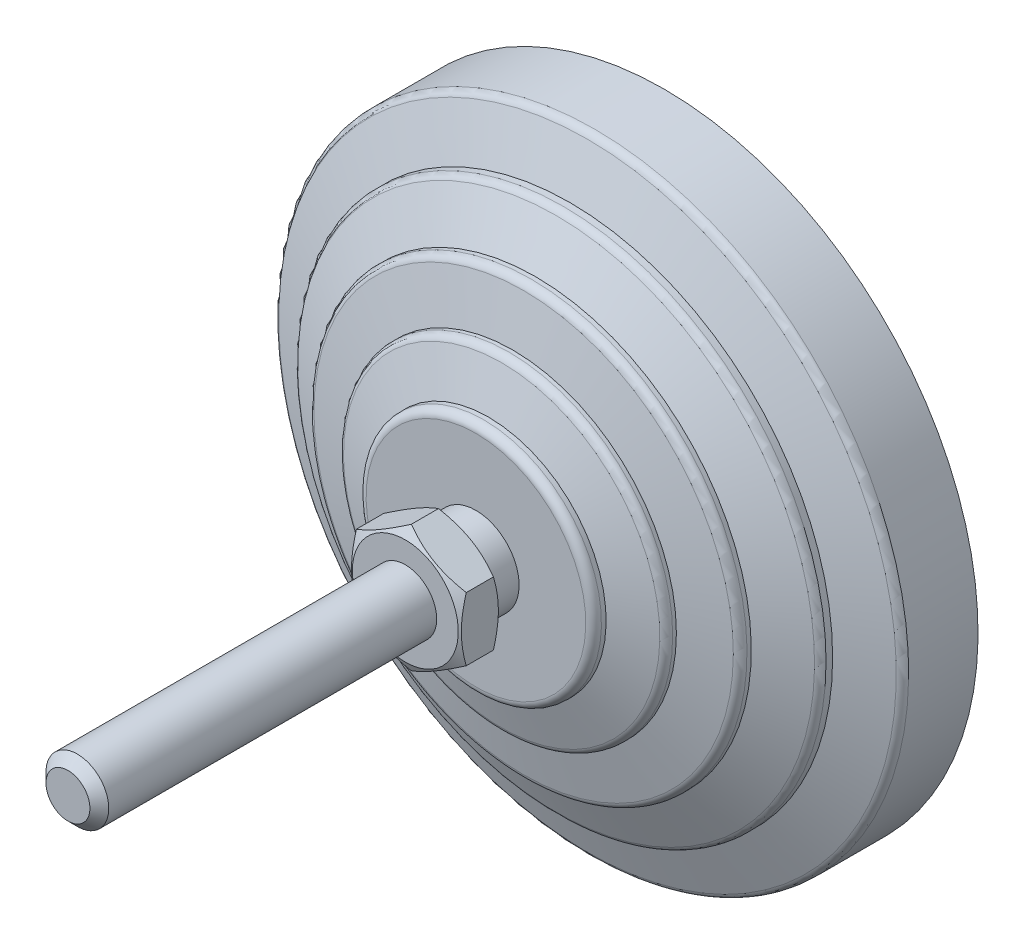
ISO-10303-21;
HEADER;
FILE_DESCRIPTION(('STEP AP214'),'2;1');
FILE_NAME('part.step','',(''),(''),'','','');
FILE_SCHEMA(('AUTOMOTIVE_DESIGN { 1 0 10303 214 1 1 1 1 }'));
ENDSEC;
DATA;
#1=APPLICATION_CONTEXT('core data for automotive mechanical design processes');
#2=APPLICATION_PROTOCOL_DEFINITION('international standard','automotive_design',2000,#1);
#3=PRODUCT_CONTEXT('',#1,'mechanical');
#4=PRODUCT('Part','Part','',(#3));
#5=PRODUCT_RELATED_PRODUCT_CATEGORY('part','',(#4));
#6=PRODUCT_DEFINITION_FORMATION('','',#4);
#7=PRODUCT_DEFINITION_CONTEXT('part definition',#1,'design');
#8=PRODUCT_DEFINITION('design','',#6,#7);
#9=PRODUCT_DEFINITION_SHAPE('','',#8);
#10=(LENGTH_UNIT() NAMED_UNIT(*) SI_UNIT(.MILLI.,.METRE.));
#11=(NAMED_UNIT(*) PLANE_ANGLE_UNIT() SI_UNIT($,.RADIAN.));
#12=(NAMED_UNIT(*) SI_UNIT($,.STERADIAN.) SOLID_ANGLE_UNIT());
#13=UNCERTAINTY_MEASURE_WITH_UNIT(LENGTH_MEASURE(1.E-05),#10,'distance_accuracy_value','');
#14=(GEOMETRIC_REPRESENTATION_CONTEXT(3) GLOBAL_UNCERTAINTY_ASSIGNED_CONTEXT((#13)) GLOBAL_UNIT_ASSIGNED_CONTEXT((#10,
#11,#12)) REPRESENTATION_CONTEXT('',''));
#15=CARTESIAN_POINT('',(0.,0.,0.));
#16=DIRECTION('',(0.,0.,1.));
#17=DIRECTION('',(1.,0.,0.));
#18=AXIS2_PLACEMENT_3D('',#15,#16,#17);
#19=CARTESIAN_POINT('',(-5.49999999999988,0.,31.));
#20=DIRECTION('',(0.,0.,1.));
#21=DIRECTION('',(0.,-1.,0.));
#22=AXIS2_PLACEMENT_3D('',#19,#20,#21);
#23=PLANE('',#22);
#24=CARTESIAN_POINT('',(0.,0.,31.));
#25=DIRECTION('',(0.,0.,-1.));
#26=DIRECTION('',(-1.,0.,0.));
#27=AXIS2_PLACEMENT_3D('',#24,#25,#26);
#28=CIRCLE('',#27,6.75);
#29=CARTESIAN_POINT('',(-6.75,0.,31.));
#30=VERTEX_POINT('',#29);
#31=EDGE_CURVE('E570',#30,#30,#28,.T.);
#32=ORIENTED_EDGE('',*,*,#31,.T.);
#33=EDGE_LOOP('',(#32));
#34=FACE_BOUND('',#33,.T.);
#35=CARTESIAN_POINT('',(0.,0.,31.));
#36=DIRECTION('',(0.,0.,-1.));
#37=DIRECTION('',(0.,1.,0.));
#38=AXIS2_PLACEMENT_3D('',#35,#36,#37);
#39=CIRCLE('',#38,5.49999999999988);
#40=CARTESIAN_POINT('',(0.,5.49999999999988,31.));
#41=VERTEX_POINT('',#40);
#42=EDGE_CURVE('E150',#41,#41,#39,.T.);
#43=ORIENTED_EDGE('',*,*,#42,.F.);
#44=EDGE_LOOP('',(#43));
#45=FACE_BOUND('',#44,.T.);
#46=ADVANCED_FACE('F14',(#34,#45),#23,.F.);
#47=CARTESIAN_POINT('',(0.,0.,0.));
#48=DIRECTION('',(0.,0.,-1.));
#49=DIRECTION('',(0.,1.,0.));
#50=AXIS2_PLACEMENT_3D('',#47,#48,#49);
#51=CYLINDRICAL_SURFACE('',#50,5.49999999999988);
#52=CARTESIAN_POINT('',(0.,0.,27.));
#53=DIRECTION('',(0.,0.,-1.));
#54=DIRECTION('',(0.,1.,0.));
#55=AXIS2_PLACEMENT_3D('',#52,#53,#54);
#56=CIRCLE('',#55,5.49999999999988);
#57=CARTESIAN_POINT('',(0.,5.49999999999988,27.));
#58=VERTEX_POINT('',#57);
#59=EDGE_CURVE('E147',#58,#58,#56,.T.);
#60=ORIENTED_EDGE('',*,*,#59,.F.);
#61=EDGE_LOOP('',(#60));
#62=FACE_BOUND('',#61,.T.);
#63=ORIENTED_EDGE('',*,*,#42,.T.);
#64=EDGE_LOOP('',(#63));
#65=FACE_BOUND('',#64,.T.);
#66=ADVANCED_FACE('F174',(#62,#65),#51,.T.);
#67=CARTESIAN_POINT('',(-5.49999999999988,0.,27.));
#68=DIRECTION('',(0.,0.,-1.));
#69=DIRECTION('',(0.,1.,0.));
#70=AXIS2_PLACEMENT_3D('',#67,#68,#69);
#71=PLANE('',#70);
#72=CARTESIAN_POINT('',(0.,0.,27.));
#73=DIRECTION('',(0.,0.,-1.));
#74=DIRECTION('',(0.,1.,0.));
#75=AXIS2_PLACEMENT_3D('',#72,#73,#74);
#76=CIRCLE('',#75,14.);
#77=CARTESIAN_POINT('',(0.,14.,27.));
#78=VERTEX_POINT('',#77);
#79=EDGE_CURVE('E144',#78,#78,#76,.T.);
#80=ORIENTED_EDGE('',*,*,#79,.F.);
#81=EDGE_LOOP('',(#80));
#82=FACE_BOUND('',#81,.T.);
#83=ORIENTED_EDGE('',*,*,#59,.T.);
#84=EDGE_LOOP('',(#83));
#85=FACE_BOUND('',#84,.T.);
#86=ADVANCED_FACE('F181',(#82,#85),#71,.F.);
#87=CARTESIAN_POINT('',(0.,0.,26.));
#88=DIRECTION('',(0.,0.,-1.));
#89=DIRECTION('',(0.,1.,0.));
#90=AXIS2_PLACEMENT_3D('',#87,#88,#89);
#91=TOROIDAL_SURFACE('',#90,14.,1.);
#92=CARTESIAN_POINT('',(0.,0.,26.));
#93=DIRECTION('',(0.,0.,-1.));
#94=DIRECTION('',(0.,1.,0.));
#95=AXIS2_PLACEMENT_3D('',#92,#93,#94);
#96=CIRCLE('',#95,15.);
#97=CARTESIAN_POINT('',(0.,15.,26.));
#98=VERTEX_POINT('',#97);
#99=EDGE_CURVE('E141',#98,#98,#96,.T.);
#100=ORIENTED_EDGE('',*,*,#99,.F.);
#101=EDGE_LOOP('',(#100));
#102=FACE_BOUND('',#101,.T.);
#103=ORIENTED_EDGE('',*,*,#79,.T.);
#104=EDGE_LOOP('',(#103));
#105=FACE_BOUND('',#104,.T.);
#106=ADVANCED_FACE('F433',(#102,#105),#91,.T.);
#107=CARTESIAN_POINT('',(0.,0.,0.));
#108=DIRECTION('',(0.,0.,-1.));
#109=DIRECTION('',(0.,1.,0.));
#110=AXIS2_PLACEMENT_3D('',#107,#108,#109);
#111=CYLINDRICAL_SURFACE('',#110,15.);
#112=CARTESIAN_POINT('',(0.,0.,25.4025287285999));
#113=DIRECTION('',(0.,0.,-1.));
#114=DIRECTION('',(0.,1.,0.));
#115=AXIS2_PLACEMENT_3D('',#112,#113,#114);
#116=CIRCLE('',#115,15.);
#117=CARTESIAN_POINT('',(0.,15.,25.4025287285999));
#118=VERTEX_POINT('',#117);
#119=EDGE_CURVE('E138',#118,#118,#116,.T.);
#120=ORIENTED_EDGE('',*,*,#119,.F.);
#121=EDGE_LOOP('',(#120));
#122=FACE_BOUND('',#121,.T.);
#123=ORIENTED_EDGE('',*,*,#99,.T.);
#124=EDGE_LOOP('',(#123));
#125=FACE_BOUND('',#124,.T.);
#126=ADVANCED_FACE('F423',(#122,#125),#111,.T.);
#127=CARTESIAN_POINT('',(0.,0.,25.4025287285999));
#128=DIRECTION('',(0.,0.,-1.));
#129=DIRECTION('',(0.,1.,0.));
#130=AXIS2_PLACEMENT_3D('',#127,#128,#129);
#131=CONICAL_SURFACE('',#130,15.,1.25589726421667);
#132=CARTESIAN_POINT('',(0.,0.,23.7216684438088));
#133=DIRECTION('',(0.,0.,-1.));
#134=DIRECTION('',(0.,1.,0.));
#135=AXIS2_PLACEMENT_3D('',#132,#133,#134);
#136=CIRCLE('',#135,20.16016354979);
#137=CARTESIAN_POINT('',(0.,20.16016354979,23.7216684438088));
#138=VERTEX_POINT('',#137);
#139=EDGE_CURVE('E135',#138,#138,#136,.T.);
#140=ORIENTED_EDGE('',*,*,#139,.F.);
#141=EDGE_LOOP('',(#140));
#142=FACE_BOUND('',#141,.T.);
#143=ORIENTED_EDGE('',*,*,#119,.T.);
#144=EDGE_LOOP('',(#143));
#145=FACE_BOUND('',#144,.T.);
#146=ADVANCED_FACE('F413',(#142,#145),#131,.T.);
#147=CARTESIAN_POINT('',(0.,0.,22.7708407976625));
#148=DIRECTION('',(0.,0.,-1.));
#149=DIRECTION('',(0.,1.,0.));
#150=AXIS2_PLACEMENT_3D('',#147,#148,#149);
#151=TOROIDAL_SURFACE('',#150,19.8504430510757,1.);
#152=CARTESIAN_POINT('',(0.,0.,22.7708407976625));
#153=DIRECTION('',(0.,0.,-1.));
#154=DIRECTION('',(0.,1.,0.));
#155=AXIS2_PLACEMENT_3D('',#152,#153,#154);
#156=CIRCLE('',#155,20.8504430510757);
#157=CARTESIAN_POINT('',(0.,20.8504430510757,22.7708407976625));
#158=VERTEX_POINT('',#157);
#159=EDGE_CURVE('E132',#158,#158,#156,.T.);
#160=ORIENTED_EDGE('',*,*,#159,.F.);
#161=EDGE_LOOP('',(#160));
#162=FACE_BOUND('',#161,.T.);
#163=ORIENTED_EDGE('',*,*,#139,.T.);
#164=EDGE_LOOP('',(#163));
#165=FACE_BOUND('',#164,.T.);
#166=ADVANCED_FACE('F403',(#162,#165),#151,.T.);
#167=CARTESIAN_POINT('',(0.,0.,0.));
#168=DIRECTION('',(0.,0.,-1.));
#169=DIRECTION('',(0.,1.,0.));
#170=AXIS2_PLACEMENT_3D('',#167,#168,#169);
#171=CYLINDRICAL_SURFACE('',#170,20.8504430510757);
#172=CARTESIAN_POINT('',(0.,0.,22.2987385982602));
#173=DIRECTION('',(0.,0.,-1.));
#174=DIRECTION('',(0.,1.,0.));
#175=AXIS2_PLACEMENT_3D('',#172,#173,#174);
#176=CIRCLE('',#175,20.8504430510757);
#177=CARTESIAN_POINT('',(0.,20.8504430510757,22.2987385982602));
#178=VERTEX_POINT('',#177);
#179=EDGE_CURVE('E129',#178,#178,#176,.T.);
#180=ORIENTED_EDGE('',*,*,#179,.F.);
#181=EDGE_LOOP('',(#180));
#182=FACE_BOUND('',#181,.T.);
#183=ORIENTED_EDGE('',*,*,#159,.T.);
#184=EDGE_LOOP('',(#183));
#185=FACE_BOUND('',#184,.T.);
#186=ADVANCED_FACE('F393',(#182,#185),#171,.T.);
#187=CARTESIAN_POINT('',(0.,0.,22.2987385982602));
#188=DIRECTION('',(0.,0.,-1.));
#189=DIRECTION('',(0.,1.,0.));
#190=AXIS2_PLACEMENT_3D('',#187,#188,#189);
#191=CONICAL_SURFACE('',#190,20.8504430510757,1.34067144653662);
#192=CARTESIAN_POINT('',(0.,0.,20.9217501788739));
#193=DIRECTION('',(0.,0.,-1.));
#194=DIRECTION('',(0.,1.,0.));
#195=AXIS2_PLACEMENT_3D('',#192,#193,#194);
#196=CIRCLE('',#195,26.7280991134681);
#197=CARTESIAN_POINT('',(0.,26.7280991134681,20.9217501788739));
#198=VERTEX_POINT('',#197);
#199=EDGE_CURVE('E126',#198,#198,#196,.T.);
#200=ORIENTED_EDGE('',*,*,#199,.F.);
#201=EDGE_LOOP('',(#200));
#202=FACE_BOUND('',#201,.T.);
#203=ORIENTED_EDGE('',*,*,#179,.T.);
#204=EDGE_LOOP('',(#203));
#205=FACE_BOUND('',#204,.T.);
#206=ADVANCED_FACE('F383',(#202,#205),#191,.T.);
#207=CARTESIAN_POINT('',(0.,0.,19.9481122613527));
#208=DIRECTION('',(0.,0.,-1.));
#209=DIRECTION('',(0.,1.,0.));
#210=AXIS2_PLACEMENT_3D('',#207,#208,#209);
#211=TOROIDAL_SURFACE('',#210,26.5,1.);
#212=CARTESIAN_POINT('',(0.,0.,19.9481122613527));
#213=DIRECTION('',(0.,0.,-1.));
#214=DIRECTION('',(0.,1.,0.));
#215=AXIS2_PLACEMENT_3D('',#212,#213,#214);
#216=CIRCLE('',#215,27.5);
#217=CARTESIAN_POINT('',(0.,27.5,19.9481122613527));
#218=VERTEX_POINT('',#217);
#219=EDGE_CURVE('E123',#218,#218,#216,.T.);
#220=ORIENTED_EDGE('',*,*,#219,.F.);
#221=EDGE_LOOP('',(#220));
#222=FACE_BOUND('',#221,.T.);
#223=ORIENTED_EDGE('',*,*,#199,.T.);
#224=EDGE_LOOP('',(#223));
#225=FACE_BOUND('',#224,.T.);
#226=ADVANCED_FACE('F373',(#222,#225),#211,.T.);
#227=CARTESIAN_POINT('',(0.,0.,0.));
#228=DIRECTION('',(0.,0.,-1.));
#229=DIRECTION('',(0.,1.,0.));
#230=AXIS2_PLACEMENT_3D('',#227,#228,#229);
#231=CYLINDRICAL_SURFACE('',#230,27.5);
#232=CARTESIAN_POINT('',(0.,0.,19.4025287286));
#233=DIRECTION('',(0.,0.,-1.));
#234=DIRECTION('',(0.,1.,0.));
#235=AXIS2_PLACEMENT_3D('',#232,#233,#234);
#236=CIRCLE('',#235,27.5);
#237=CARTESIAN_POINT('',(0.,27.5,19.4025287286));
#238=VERTEX_POINT('',#237);
#239=EDGE_CURVE('E120',#238,#238,#236,.T.);
#240=ORIENTED_EDGE('',*,*,#239,.F.);
#241=EDGE_LOOP('',(#240));
#242=FACE_BOUND('',#241,.T.);
#243=ORIENTED_EDGE('',*,*,#219,.T.);
#244=EDGE_LOOP('',(#243));
#245=FACE_BOUND('',#244,.T.);
#246=ADVANCED_FACE('F363',(#242,#245),#231,.T.);
#247=CARTESIAN_POINT('',(0.,0.,19.4025287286));
#248=DIRECTION('',(0.,0.,-1.));
#249=DIRECTION('',(0.,1.,0.));
#250=AXIS2_PLACEMENT_3D('',#247,#248,#249);
#251=CONICAL_SURFACE('',#250,27.5,1.12022914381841);
#252=CARTESIAN_POINT('',(0.,0.,16.7730910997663));
#253=DIRECTION('',(0.,0.,-1.));
#254=DIRECTION('',(0.,1.,0.));
#255=AXIS2_PLACEMENT_3D('',#252,#253,#254);
#256=CIRCLE('',#255,32.9354761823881);
#257=CARTESIAN_POINT('',(0.,32.9354761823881,16.7730910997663));
#258=VERTEX_POINT('',#257);
#259=EDGE_CURVE('E117',#258,#258,#256,.T.);
#260=ORIENTED_EDGE('',*,*,#259,.F.);
#261=EDGE_LOOP('',(#260));
#262=FACE_BOUND('',#261,.T.);
#263=ORIENTED_EDGE('',*,*,#239,.T.);
#264=EDGE_LOOP('',(#263));
#265=FACE_BOUND('',#264,.T.);
#266=ADVANCED_FACE('F353',(#262,#265),#251,.T.);
#267=CARTESIAN_POINT('',(0.,0.,15.872890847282));
#268=DIRECTION('',(0.,0.,-1.));
#269=DIRECTION('',(0.,1.,0.));
#270=AXIS2_PLACEMENT_3D('',#267,#268,#269);
#271=TOROIDAL_SURFACE('',#270,32.5,1.);
#272=CARTESIAN_POINT('',(0.,0.,15.872890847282));
#273=DIRECTION('',(0.,0.,-1.));
#274=DIRECTION('',(0.,1.,0.));
#275=AXIS2_PLACEMENT_3D('',#272,#273,#274);
#276=CIRCLE('',#275,33.5);
#277=CARTESIAN_POINT('',(0.,33.5,15.872890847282));
#278=VERTEX_POINT('',#277);
#279=EDGE_CURVE('E114',#278,#278,#276,.T.);
#280=ORIENTED_EDGE('',*,*,#279,.F.);
#281=EDGE_LOOP('',(#280));
#282=FACE_BOUND('',#281,.T.);
#283=ORIENTED_EDGE('',*,*,#259,.T.);
#284=EDGE_LOOP('',(#283));
#285=FACE_BOUND('',#284,.T.);
#286=ADVANCED_FACE('F343',(#282,#285),#271,.T.);
#287=CARTESIAN_POINT('',(0.,0.,0.));
#288=DIRECTION('',(0.,0.,-1.));
#289=DIRECTION('',(0.,1.,0.));
#290=AXIS2_PLACEMENT_3D('',#287,#288,#289);
#291=CYLINDRICAL_SURFACE('',#290,33.5);
#292=CARTESIAN_POINT('',(0.,0.,15.0315037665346));
#293=DIRECTION('',(0.,0.,-1.));
#294=DIRECTION('',(0.,1.,0.));
#295=AXIS2_PLACEMENT_3D('',#292,#293,#294);
#296=CIRCLE('',#295,33.5);
#297=CARTESIAN_POINT('',(0.,33.5,15.0315037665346));
#298=VERTEX_POINT('',#297);
#299=EDGE_CURVE('E111',#298,#298,#296,.T.);
#300=ORIENTED_EDGE('',*,*,#299,.F.);
#301=EDGE_LOOP('',(#300));
#302=FACE_BOUND('',#301,.T.);
#303=ORIENTED_EDGE('',*,*,#279,.T.);
#304=EDGE_LOOP('',(#303));
#305=FACE_BOUND('',#304,.T.);
#306=ADVANCED_FACE('F333',(#302,#305),#291,.T.);
#307=CARTESIAN_POINT('',(0.,0.,15.0315037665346));
#308=DIRECTION('',(0.,0.,-1.));
#309=DIRECTION('',(0.,1.,0.));
#310=AXIS2_PLACEMENT_3D('',#307,#308,#309);
#311=CONICAL_SURFACE('',#310,33.5,1.20362249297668);
#312=CARTESIAN_POINT('',(0.,0.,12.7780502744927));
#313=DIRECTION('',(0.,0.,-1.));
#314=DIRECTION('',(0.,1.,0.));
#315=AXIS2_PLACEMENT_3D('',#312,#313,#314);
#316=CIRCLE('',#315,39.358979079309);
#317=CARTESIAN_POINT('',(0.,39.358979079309,12.7780502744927));
#318=VERTEX_POINT('',#317);
#319=EDGE_CURVE('E108',#318,#318,#316,.T.);
#320=ORIENTED_EDGE('',*,*,#319,.F.);
#321=EDGE_LOOP('',(#320));
#322=FACE_BOUND('',#321,.T.);
#323=ORIENTED_EDGE('',*,*,#299,.T.);
#324=EDGE_LOOP('',(#323));
#325=FACE_BOUND('',#324,.T.);
#326=ADVANCED_FACE('F323',(#322,#325),#311,.T.);
#327=CARTESIAN_POINT('',(0.,0.,11.8447046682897));
#328=DIRECTION('',(0.,0.,-1.));
#329=DIRECTION('',(0.,1.,0.));
#330=AXIS2_PLACEMENT_3D('',#327,#328,#329);
#331=TOROIDAL_SURFACE('',#330,39.,1.);
#332=CARTESIAN_POINT('',(0.,0.,11.8447046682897));
#333=DIRECTION('',(0.,0.,-1.));
#334=DIRECTION('',(0.,1.,0.));
#335=AXIS2_PLACEMENT_3D('',#332,#333,#334);
#336=CIRCLE('',#335,40.);
#337=CARTESIAN_POINT('',(0.,40.,11.8447046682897));
#338=VERTEX_POINT('',#337);
#339=EDGE_CURVE('E105',#338,#338,#336,.T.);
#340=ORIENTED_EDGE('',*,*,#339,.F.);
#341=EDGE_LOOP('',(#340));
#342=FACE_BOUND('',#341,.T.);
#343=ORIENTED_EDGE('',*,*,#319,.T.);
#344=EDGE_LOOP('',(#343));
#345=FACE_BOUND('',#344,.T.);
#346=ADVANCED_FACE('F313',(#342,#345),#331,.T.);
#347=CARTESIAN_POINT('',(0.,0.,0.));
#348=DIRECTION('',(0.,0.,-1.));
#349=DIRECTION('',(0.,1.,0.));
#350=AXIS2_PLACEMENT_3D('',#347,#348,#349);
#351=CYLINDRICAL_SURFACE('',#350,40.);
#352=CARTESIAN_POINT('',(0.,0.,3.00000000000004));
#353=DIRECTION('',(0.,0.,-1.));
#354=DIRECTION('',(0.,1.,0.));
#355=AXIS2_PLACEMENT_3D('',#352,#353,#354);
#356=CIRCLE('',#355,40.);
#357=CARTESIAN_POINT('',(0.,40.,3.00000000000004));
#358=VERTEX_POINT('',#357);
#359=EDGE_CURVE('E102',#358,#358,#356,.T.);
#360=ORIENTED_EDGE('',*,*,#359,.F.);
#361=EDGE_LOOP('',(#360));
#362=FACE_BOUND('',#361,.T.);
#363=ORIENTED_EDGE('',*,*,#339,.T.);
#364=EDGE_LOOP('',(#363));
#365=FACE_BOUND('',#364,.T.);
#366=ADVANCED_FACE('F303',(#362,#365),#351,.T.);
#367=CARTESIAN_POINT('',(-33.5,0.,3.00000000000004));
#368=DIRECTION('',(0.,0.,1.));
#369=DIRECTION('',(0.,-1.,0.));
#370=AXIS2_PLACEMENT_3D('',#367,#368,#369);
#371=PLANE('',#370);
#372=CARTESIAN_POINT('',(0.,0.,3.00000000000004));
#373=DIRECTION('',(0.,0.,-1.));
#374=DIRECTION('',(0.,1.,0.));
#375=AXIS2_PLACEMENT_3D('',#372,#373,#374);
#376=CIRCLE('',#375,33.5);
#377=CARTESIAN_POINT('',(0.,33.5,3.00000000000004));
#378=VERTEX_POINT('',#377);
#379=EDGE_CURVE('E99',#378,#378,#376,.T.);
#380=ORIENTED_EDGE('',*,*,#379,.F.);
#381=EDGE_LOOP('',(#380));
#382=FACE_BOUND('',#381,.T.);
#383=ORIENTED_EDGE('',*,*,#359,.T.);
#384=EDGE_LOOP('',(#383));
#385=FACE_BOUND('',#384,.T.);
#386=ADVANCED_FACE('F293',(#382,#385),#371,.F.);
#387=CARTESIAN_POINT('',(0.,0.,0.));
#388=DIRECTION('',(0.,0.,-1.));
#389=DIRECTION('',(0.,1.,0.));
#390=AXIS2_PLACEMENT_3D('',#387,#388,#389);
#391=CYLINDRICAL_SURFACE('',#390,33.5);
#392=CARTESIAN_POINT('',(0.,0.,0.));
#393=DIRECTION('',(0.,0.,-1.));
#394=DIRECTION('',(0.,1.,0.));
#395=AXIS2_PLACEMENT_3D('',#392,#393,#394);
#396=CIRCLE('',#395,33.5);
#397=CARTESIAN_POINT('',(0.,33.5,0.));
#398=VERTEX_POINT('',#397);
#399=EDGE_CURVE('E96',#398,#398,#396,.T.);
#400=ORIENTED_EDGE('',*,*,#399,.F.);
#401=EDGE_LOOP('',(#400));
#402=FACE_BOUND('',#401,.T.);
#403=ORIENTED_EDGE('',*,*,#379,.T.);
#404=EDGE_LOOP('',(#403));
#405=FACE_BOUND('',#404,.T.);
#406=ADVANCED_FACE('F282',(#402,#405),#391,.T.);
#407=CARTESIAN_POINT('',(0.,0.,0.));
#408=DIRECTION('',(0.,0.,1.));
#409=DIRECTION('',(0.,-1.,0.));
#410=AXIS2_PLACEMENT_3D('',#407,#408,#409);
#411=PLANE('',#410);
#412=ORIENTED_EDGE('',*,*,#399,.T.);
#413=EDGE_LOOP('',(#412));
#414=FACE_BOUND('',#413,.T.);
#415=ADVANCED_FACE('F172',(#414),#411,.F.);
#416=CARTESIAN_POINT('',(0.,0.,32.5960899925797));
#417=DIRECTION('',(0.,0.,1.));
#418=DIRECTION('',(1.,0.,0.));
#419=AXIS2_PLACEMENT_3D('',#416,#417,#418);
#420=CONICAL_SURFACE('',#419,9.51450896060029,1.04719755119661);
#421=CARTESIAN_POINT('',(0.255585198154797,-8.23046595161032,31.8570380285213));
#422=CARTESIAN_POINT('',(-0.0710236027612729,-8.04189827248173,31.7423545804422));
#423=CARTESIAN_POINT('',(-0.400687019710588,-7.85156700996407,31.6373975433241));
#424=CARTESIAN_POINT('',(-1.06639033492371,-7.46722302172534,31.45314816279));
#425=CARTESIAN_POINT('',(-1.40244708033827,-7.27320056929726,31.373937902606));
#426=CARTESIAN_POINT('',(-1.90511265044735,-6.98298646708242,31.2805358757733));
#427=CARTESIAN_POINT('',(-2.06997494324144,-6.88780317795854,31.2538570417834));
#428=CARTESIAN_POINT('',(-2.40056177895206,-6.69693877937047,31.2088490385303));
#429=CARTESIAN_POINT('',(-2.56628633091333,-6.6012576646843,31.1905199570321));
#430=CARTESIAN_POINT('',(-2.89802797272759,-6.40972653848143,31.1627344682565));
#431=CARTESIAN_POINT('',(-3.06404415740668,-6.31387704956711,31.1532637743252));
#432=CARTESIAN_POINT('',(-3.39627976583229,-6.12206073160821,31.1434147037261));
#433=CARTESIAN_POINT('',(-3.56249918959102,-6.02609390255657,31.1430363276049));
#434=CARTESIAN_POINT('',(-3.90519186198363,-5.82824019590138,31.1516472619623));
#435=CARTESIAN_POINT('',(-4.08165411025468,-5.72635966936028,31.1612258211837));
#436=CARTESIAN_POINT('',(-4.43395850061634,-5.52295663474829,31.1903578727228));
#437=CARTESIAN_POINT('',(-4.60980062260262,-5.42143413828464,31.209911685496));
#438=CARTESIAN_POINT('',(-4.96083363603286,-5.21876513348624,31.2584436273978));
#439=CARTESIAN_POINT('',(-5.13602268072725,-5.11761969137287,31.2874394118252));
#440=CARTESIAN_POINT('',(-5.48517016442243,-4.91603929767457,31.3540506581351));
#441=CARTESIAN_POINT('',(-5.65912851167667,-4.81560439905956,31.3916667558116));
#442=CARTESIAN_POINT('',(-6.01118319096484,-4.61234553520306,31.4759438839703));
#443=CARTESIAN_POINT('',(-6.18923425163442,-4.50954770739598,31.5228554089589));
#444=CARTESIAN_POINT('',(-6.54380291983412,-4.30483739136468,31.6239006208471));
#445=CARTESIAN_POINT('',(-6.72032036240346,-4.2029249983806,31.6780350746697));
#446=CARTESIAN_POINT('',(-7.0710881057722,-4.00040914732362,31.7923218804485));
#447=CARTESIAN_POINT('',(-7.24534476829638,-3.8998020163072,31.8524483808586));
#448=CARTESIAN_POINT('',(-7.59233945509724,-3.69946454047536,31.9780433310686));
#449=CARTESIAN_POINT('',(-7.76507802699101,-3.59973387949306,32.0435097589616));
#450=CARTESIAN_POINT('',(-7.93712715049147,-3.50040127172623,32.1112385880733));
#451=B_SPLINE_CURVE_WITH_KNOTS('',3,(#421,#422,#423,#424,#425,#426,#427,#428,#429,#430,#431,
#432,#433,#434,#435,#436,#437,#438,#439,#440,#441,#442,#443,#444,#445,#446,#447,#448,#449,#450),
.UNSPECIFIED.,.F.,.F.,(4,2,2,2,2,2,2,2,2,2,2,2,2,2,4),(0.,1.18330534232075,2.3703469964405,
2.94685891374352,3.52337689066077,4.09896345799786,4.67455005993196,5.28625084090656,
5.89797127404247,6.5108421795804,7.12375830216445,7.75624855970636,8.38880602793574,
9.01874376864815,9.64844408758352),.UNSPECIFIED.);
#452=CARTESIAN_POINT('',(0.,-8.08290376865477,31.7695523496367));
#453=VERTEX_POINT('',#452);
#454=CARTESIAN_POINT('',(-7.,-4.04145188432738,31.7695523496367));
#455=VERTEX_POINT('',#454);
#456=EDGE_CURVE('E73',#453,#455,#451,.T.);
#457=ORIENTED_EDGE('',*,*,#456,.T.);
#458=CARTESIAN_POINT('',(-7.,-10.8134381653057,34.5399649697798));
#459=CARTESIAN_POINT('',(-7.,-10.5080539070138,34.3919972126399));
#460=CARTESIAN_POINT('',(-7.,-10.2019640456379,34.2454605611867));
#461=CARTESIAN_POINT('',(-7.,-9.58799769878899,33.9560552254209));
#462=CARTESIAN_POINT('',(-7.,-9.28012093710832,33.81318712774));
#463=CARTESIAN_POINT('',(-7.,-8.6605986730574,33.5311967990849));
#464=CARTESIAN_POINT('',(-7.,-8.34894175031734,33.3920995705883));
#465=CARTESIAN_POINT('',(-7.,-7.72313423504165,33.1196544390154));
#466=CARTESIAN_POINT('',(-7.,-7.40898376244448,32.9863062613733));
#467=CARTESIAN_POINT('',(-7.,-6.76771648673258,32.7227802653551));
#468=CARTESIAN_POINT('',(-7.,-6.44050341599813,32.5928353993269));
#469=CARTESIAN_POINT('',(-7.,-5.78223427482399,32.3428834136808));
#470=CARTESIAN_POINT('',(-7.,-5.45117777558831,32.2228774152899));
#471=CARTESIAN_POINT('',(-7.,-4.78532454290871,31.9959850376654));
#472=CARTESIAN_POINT('',(-7.,-4.45053708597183,31.8890717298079));
#473=CARTESIAN_POINT('',(-7.,-3.77617235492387,31.6918218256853));
#474=CARTESIAN_POINT('',(-7.,-3.4365966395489,31.6014799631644));
#475=CARTESIAN_POINT('',(-7.,-2.75428107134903,31.4422202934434));
#476=CARTESIAN_POINT('',(-7.,-2.41156868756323,31.3731879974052));
#477=CARTESIAN_POINT('',(-7.,-1.89441347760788,31.2886317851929));
#478=CARTESIAN_POINT('',(-7.,-1.7215009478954,31.2636105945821));
#479=CARTESIAN_POINT('',(-7.,-1.37483092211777,31.2203906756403));
#480=CARTESIAN_POINT('',(-7.,-1.20107350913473,31.2021912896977));
#481=CARTESIAN_POINT('',(-7.,-0.855197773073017,31.1732036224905));
#482=CARTESIAN_POINT('',(-7.,-0.68308724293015,31.1623227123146));
#483=CARTESIAN_POINT('',(-7.,-0.338560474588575,31.14784589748));
#484=CARTESIAN_POINT('',(-7.,-0.166144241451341,31.1442498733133));
#485=CARTESIAN_POINT('',(-7.,0.178686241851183,31.1444285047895));
#486=CARTESIAN_POINT('',(-7.,0.351100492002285,31.1482031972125));
#487=CARTESIAN_POINT('',(-7.,0.695617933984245,31.1630317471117));
#488=CARTESIAN_POINT('',(-7.,0.86772110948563,31.1740859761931));
#489=CARTESIAN_POINT('',(-7.,1.28263082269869,31.2092782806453));
#490=CARTESIAN_POINT('',(-7.,1.52514448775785,31.2369420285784));
#491=CARTESIAN_POINT('',(-7.,2.00833249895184,31.3052046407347));
#492=CARTESIAN_POINT('',(-7.,2.24900658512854,31.3458052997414));
#493=CARTESIAN_POINT('',(-7.,2.96801639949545,31.4848563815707));
#494=CARTESIAN_POINT('',(-7.,3.44306327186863,31.60052939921));
#495=CARTESIAN_POINT('',(-7.,4.15333083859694,31.8006214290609));
#496=CARTESIAN_POINT('',(-7.,4.39224804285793,31.8726693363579));
#497=CARTESIAN_POINT('',(-7.,4.86776106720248,32.0241248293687));
#498=CARTESIAN_POINT('',(-7.,5.10435687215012,32.103532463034));
#499=CARTESIAN_POINT('',(-7.,5.57530393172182,32.268443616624));
#500=CARTESIAN_POINT('',(-7.,5.80965592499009,32.3539450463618));
#501=CARTESIAN_POINT('',(-7.,6.27642655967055,32.5300501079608));
#502=CARTESIAN_POINT('',(-7.,6.50884522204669,32.6206536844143));
#503=CARTESIAN_POINT('',(-7.,7.05042997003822,32.837535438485));
#504=CARTESIAN_POINT('',(-7.,7.35891938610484,32.965500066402));
#505=CARTESIAN_POINT('',(-7.,7.97333483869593,33.2274591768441));
#506=CARTESIAN_POINT('',(-7.,8.27926072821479,33.361454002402));
#507=CARTESIAN_POINT('',(-7.,8.88901160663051,33.6342818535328));
#508=CARTESIAN_POINT('',(-7.,9.19283618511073,33.7731157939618));
#509=CARTESIAN_POINT('',(-7.,9.79868269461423,34.0546694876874));
#510=CARTESIAN_POINT('',(-7.,10.1007045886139,34.1973893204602));
#511=CARTESIAN_POINT('',(-7.,10.703538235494,34.4861410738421));
#512=CARTESIAN_POINT('',(-7.,11.0043484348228,34.6321762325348));
#513=CARTESIAN_POINT('',(-7.,11.6046860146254,34.9268623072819));
#514=CARTESIAN_POINT('',(-7.,11.9042133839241,35.0755132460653));
#515=CARTESIAN_POINT('',(-7.,12.8010980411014,35.5246663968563));
#516=CARTESIAN_POINT('',(-7.,13.3968340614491,35.8284057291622));
#517=CARTESIAN_POINT('',(-7.,14.536464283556,36.4168465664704));
#518=CARTESIAN_POINT('',(-7.,15.080606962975,36.7010689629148));
#519=CARTESIAN_POINT('',(-7.,16.1668650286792,37.273402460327));
#520=CARTESIAN_POINT('',(-7.,16.7089803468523,37.5615136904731));
#521=CARTESIAN_POINT('',(-7.,17.7903277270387,38.1400111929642));
#522=CARTESIAN_POINT('',(-7.,18.3295635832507,38.4303903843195));
#523=CARTESIAN_POINT('',(-7.,19.4067350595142,39.0134835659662));
#524=CARTESIAN_POINT('',(-7.,19.9446707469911,39.3061974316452));
#525=CARTESIAN_POINT('',(-7.,20.4821259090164,39.5997850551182));
#526=B_SPLINE_CURVE_WITH_KNOTS('',3,(#458,#459,#460,#461,#462,#463,#464,#465,#466,#467,#468,
#469,#470,#471,#472,#473,#474,#475,#476,#477,#478,#479,#480,#481,#482,#483,#484,#485,#486,#487,
#488,#489,#490,#491,#492,#493,#494,#495,#496,#497,#498,#499,#500,#501,#502,#503,#504,#505,#506,
#507,#508,#509,#510,#511,#512,#513,#514,#515,#516,#517,#518,#519,#520,#521,#522,#523,#524,#525),
.UNSPECIFIED.,.F.,.F.,(4,2,2,2,2,2,2,2,2,2,2,2,2,2,2,2,2,2,2,2,2,2,2,2,2,2,2,2,2,2,2,2,2,4),(0.,
1.01804309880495,2.03624798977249,3.06006802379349,4.08383910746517,5.13992716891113,
6.19613420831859,7.25013102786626,8.30379231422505,9.3516899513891,9.87571699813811,
10.3996935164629,10.9169066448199,11.4341112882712,11.9513185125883,12.4685521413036,
13.2003968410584,13.9323431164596,15.3970649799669,16.1456368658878,16.8942136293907,
17.6425348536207,18.3908479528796,19.3926934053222,20.3945959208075,21.3966888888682,
22.39880236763,23.4019407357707,24.4050878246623,26.4111282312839,28.252812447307,
30.0945579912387,31.9319028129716,33.7691502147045),.UNSPECIFIED.);
#527=CARTESIAN_POINT('',(-7.,4.04145188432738,31.7695523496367));
#528=VERTEX_POINT('',#527);
#529=EDGE_CURVE('E81',#455,#528,#526,.T.);
#530=ORIENTED_EDGE('',*,*,#529,.T.);
#531=CARTESIAN_POINT('',(-12.7047499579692,0.747812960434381,34.4506721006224));
#532=CARTESIAN_POINT('',(-12.4356282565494,0.903190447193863,34.3008804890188));
#533=CARTESIAN_POINT('',(-12.165853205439,1.05894514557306,34.1526241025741));
#534=CARTESIAN_POINT('',(-11.6246350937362,1.37141756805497,33.8600778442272));
#535=CARTESIAN_POINT('',(-11.3531917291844,1.52813546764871,33.7157887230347));
#536=CARTESIAN_POINT('',(-10.8066561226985,1.84367794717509,33.4312342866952));
#537=CARTESIAN_POINT('',(-10.5315516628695,2.00250958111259,33.2910001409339));
#538=CARTESIAN_POINT('',(-9.97900474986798,2.32152269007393,33.0168396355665));
#539=CARTESIAN_POINT('',(-9.70156243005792,2.48170408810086,32.8829129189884));
#540=CARTESIAN_POINT('',(-9.14124867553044,2.80520138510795,32.6218686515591));
#541=CARTESIAN_POINT('',(-8.85835073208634,2.96853258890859,32.4948265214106));
#542=CARTESIAN_POINT('',(-8.28911434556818,3.29718136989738,32.2512599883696));
#543=CARTESIAN_POINT('',(-8.00277549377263,3.46249918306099,32.1347368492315));
#544=CARTESIAN_POINT('',(-7.42686090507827,3.79500362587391,31.915576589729));
#545=CARTESIAN_POINT('',(-7.13729465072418,3.96218478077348,31.8129066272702));
#546=CARTESIAN_POINT('',(-6.55400049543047,4.29894981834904,31.6250170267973));
#547=CARTESIAN_POINT('',(-6.26027407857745,4.46853284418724,31.5397913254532));
#548=CARTESIAN_POINT('',(-5.6734965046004,4.80730903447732,31.3924930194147));
#549=CARTESIAN_POINT('',(-5.38051534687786,4.97646178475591,31.3300589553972));
#550=CARTESIAN_POINT('',(-4.93863275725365,5.23158281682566,31.2554912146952));
#551=CARTESIAN_POINT('',(-4.79091725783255,5.31686640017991,31.23381427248));
#552=CARTESIAN_POINT('',(-4.49486187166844,5.4877940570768,31.1972510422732));
#553=CARTESIAN_POINT('',(-4.34652204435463,5.57343809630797,31.1823641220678));
#554=CARTESIAN_POINT('',(-4.0502688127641,5.74447997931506,31.1597734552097));
#555=CARTESIAN_POINT('',(-3.90235769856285,5.82987650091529,31.1520298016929));
#556=CARTESIAN_POINT('',(-3.60638508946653,6.00075636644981,31.1437578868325));
#557=CARTESIAN_POINT('',(-3.45832359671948,6.08623970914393,31.1432295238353));
#558=CARTESIAN_POINT('',(-3.16235092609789,6.25711961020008,31.149400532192));
#559=CARTESIAN_POINT('',(-3.01443971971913,6.34251618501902,31.1560980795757));
#560=CARTESIAN_POINT('',(-2.71898221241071,6.51309865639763,31.1765619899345));
#561=CARTESIAN_POINT('',(-2.57143593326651,6.59828454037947,31.1903287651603));
#562=CARTESIAN_POINT('',(-2.20760552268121,6.80834212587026,31.2327150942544));
#563=CARTESIAN_POINT('',(-1.99165962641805,6.93301854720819,31.265275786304));
#564=CARTESIAN_POINT('',(-1.5615907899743,7.18131890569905,31.3436717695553));
#565=CARTESIAN_POINT('',(-1.34746815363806,7.30494266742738,31.3895092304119));
#566=CARTESIAN_POINT('',(-0.707395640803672,7.67448870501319,31.5446195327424));
#567=CARTESIAN_POINT('',(-0.284594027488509,7.91859333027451,31.6713787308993));
#568=CARTESIAN_POINT('',(0.347511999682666,8.28353991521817,31.8880366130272));
#569=CARTESIAN_POINT('',(0.560155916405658,8.40630993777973,31.9656667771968));
#570=CARTESIAN_POINT('',(0.983390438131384,8.65066450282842,32.1281935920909));
#571=CARTESIAN_POINT('',(1.19398086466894,8.77224894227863,32.2130908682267));
#572=CARTESIAN_POINT('',(1.61205220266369,9.01362254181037,32.3883694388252));
#573=CARTESIAN_POINT('',(1.81954403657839,9.13341800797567,32.4787163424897));
#574=CARTESIAN_POINT('',(2.23279310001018,9.37200746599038,32.6643339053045));
#575=CARTESIAN_POINT('',(2.4385508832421,9.49080177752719,32.7596029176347));
#576=CARTESIAN_POINT('',(2.64358350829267,9.60917741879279,32.8568647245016));
#577=B_SPLINE_CURVE_WITH_KNOTS('',3,(#531,#532,#533,#534,#535,#536,#537,#538,#539,#540,#541,
#542,#543,#544,#545,#546,#547,#548,#549,#550,#551,#552,#553,#554,#555,#556,#557,#558,#559,#560,
#561,#562,#563,#564,#565,#566,#567,#568,#569,#570,#571,#572,#573,#574,#575,#576),.UNSPECIFIED.,
.F.,.F.,(4,2,2,2,2,2,2,2,2,2,2,2,2,2,2,2,2,2,2,2,2,2,4),(0.,1.03493334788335,2.0700612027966,
3.11172675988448,4.15333329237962,5.20468407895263,6.25616100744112,7.30509964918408,
8.35367307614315,9.38480908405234,9.90051211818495,10.416167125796,10.928923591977,
11.4416728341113,11.954292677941,12.4669424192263,13.2209183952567,13.9750176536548,
15.4861764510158,16.258681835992,17.0312537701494,17.799377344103,18.5672455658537),.UNSPECIFIED.);
#578=CARTESIAN_POINT('',(0.,8.08290376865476,31.7695523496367));
#579=VERTEX_POINT('',#578);
#580=EDGE_CURVE('E525',#528,#579,#577,.T.);
#581=ORIENTED_EDGE('',*,*,#580,.T.);
#582=CARTESIAN_POINT('',(-0.944288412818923,8.62808893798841,32.1140598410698));
#583=CARTESIAN_POINT('',(-0.772137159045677,8.52869736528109,32.0462196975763));
#584=CARTESIAN_POINT('',(-0.599296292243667,8.42890764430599,31.9806401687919));
#585=CARTESIAN_POINT('',(-0.25209604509,8.22845148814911,31.8548158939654));
#586=CARTESIAN_POINT('',(-0.0777361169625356,8.12778473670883,31.7945731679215));
#587=CARTESIAN_POINT('',(0.273241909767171,7.9251474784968,31.6800502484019));
#588=CARTESIAN_POINT('',(0.449866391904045,7.82317328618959,31.6257959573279));
#589=CARTESIAN_POINT('',(0.804651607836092,7.61833794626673,31.5245097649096));
#590=CARTESIAN_POINT('',(0.982812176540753,7.51547689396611,31.4774770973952));
#591=CARTESIAN_POINT('',(1.33508230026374,7.31209364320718,31.3929628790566));
#592=CARTESIAN_POINT('',(1.50914645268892,7.21159765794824,31.355230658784));
#593=CARTESIAN_POINT('',(1.85850942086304,7.00989285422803,31.2883899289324));
#594=CARTESIAN_POINT('',(2.03380814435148,6.90868408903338,31.2592807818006));
#595=CARTESIAN_POINT('',(2.38506431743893,6.70588624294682,31.2105283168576));
#596=CARTESIAN_POINT('',(2.56101990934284,6.60429823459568,31.1908673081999));
#597=CARTESIAN_POINT('',(2.9135557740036,6.40076155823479,31.1615303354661));
#598=CARTESIAN_POINT('',(3.09013602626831,6.29881290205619,31.1518540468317));
#599=CARTESIAN_POINT('',(3.43286063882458,6.10094075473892,31.1430711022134));
#600=CARTESIAN_POINT('',(3.59899355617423,6.00502387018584,31.1433634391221));
#601=CARTESIAN_POINT('',(3.93105993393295,5.81330525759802,31.15303231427));
#602=CARTESIAN_POINT('',(4.09699339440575,5.71750352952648,31.1624088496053));
#603=CARTESIAN_POINT('',(4.42857285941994,5.52606603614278,31.1900006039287));
#604=CARTESIAN_POINT('',(4.59421796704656,5.43043078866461,31.2082300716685));
#605=CARTESIAN_POINT('',(4.92464962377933,5.23965598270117,31.2530362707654));
#606=CARTESIAN_POINT('',(5.08943618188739,5.14451641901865,31.2796129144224));
#607=CARTESIAN_POINT('',(5.5918664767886,4.85443815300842,31.3727009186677));
#608=CARTESIAN_POINT('',(5.9277689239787,4.66050478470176,31.4516986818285));
#609=CARTESIAN_POINT('',(6.59317546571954,4.27633213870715,31.6355347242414));
#610=CARTESIAN_POINT('',(6.92269632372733,4.08608318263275,31.7402911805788));
#611=CARTESIAN_POINT('',(7.24916328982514,3.89759739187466,31.8547847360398));
#612=B_SPLINE_CURVE_WITH_KNOTS('',3,(#582,#583,#584,#585,#586,#587,#588,#589,#590,#591,#592,
#593,#594,#595,#596,#597,#598,#599,#600,#601,#602,#603,#604,#605,#606,#607,#608,#609,#610,#611),
.UNSPECIFIED.,.F.,.F.,(4,2,2,2,2,2,2,2,2,2,2,2,2,2,4),(0.,0.63014298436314,1.26052346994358,
1.89353177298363,2.52647287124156,3.13981346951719,3.75310870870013,4.36525108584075,
4.977373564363,5.55266042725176,6.12794710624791,6.7041627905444,7.28037242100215,
8.46676203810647,9.64943067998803),.UNSPECIFIED.);
#613=CARTESIAN_POINT('',(7.,4.04145188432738,31.7695523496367));
#614=VERTEX_POINT('',#613);
#615=EDGE_CURVE('E520',#579,#614,#612,.T.);
#616=ORIENTED_EDGE('',*,*,#615,.T.);
#617=CARTESIAN_POINT('',(7.,-10.8134381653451,34.539964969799));
#618=CARTESIAN_POINT('',(7.,-10.5080539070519,34.3919972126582));
#619=CARTESIAN_POINT('',(7.,-10.2019640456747,34.2454605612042));
#620=CARTESIAN_POINT('',(7.,-9.58799769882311,33.9560552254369));
#621=CARTESIAN_POINT('',(7.,-9.28012093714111,33.8131871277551));
#622=CARTESIAN_POINT('',(7.,-8.66059867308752,33.5311967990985));
#623=CARTESIAN_POINT('',(7.,-8.34894175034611,33.392099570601));
#624=CARTESIAN_POINT('',(7.,-7.72313423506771,33.1196544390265));
#625=CARTESIAN_POINT('',(7.,-7.40898376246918,32.9863062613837));
#626=CARTESIAN_POINT('',(7.,-6.76771648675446,32.7227802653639));
#627=CARTESIAN_POINT('',(7.,-6.44050341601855,32.5928353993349));
#628=CARTESIAN_POINT('',(7.,-5.78223427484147,32.3428834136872));
#629=CARTESIAN_POINT('',(7.,-5.45117777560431,32.2228774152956));
#630=CARTESIAN_POINT('',(7.,-4.78532454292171,31.9959850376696));
#631=CARTESIAN_POINT('',(7.,-4.45053708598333,31.8890717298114));
#632=CARTESIAN_POINT('',(7.,-3.77617235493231,31.6918218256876));
#633=CARTESIAN_POINT('',(7.,-3.43659663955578,31.6014799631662));
#634=CARTESIAN_POINT('',(7.,-2.75428107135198,31.442220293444));
#635=CARTESIAN_POINT('',(7.,-2.41156868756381,31.3731879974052));
#636=CARTESIAN_POINT('',(7.,-1.89441347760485,31.2886317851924));
#637=CARTESIAN_POINT('',(7.,-1.72150094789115,31.2636105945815));
#638=CARTESIAN_POINT('',(7.,-1.3748309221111,31.2203906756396));
#639=CARTESIAN_POINT('',(7.,-1.20107350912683,31.2021912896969));
#640=CARTESIAN_POINT('',(7.,-0.855197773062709,31.1732036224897));
#641=CARTESIAN_POINT('',(7.,-0.683087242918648,31.162322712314));
#642=CARTESIAN_POINT('',(7.,-0.338560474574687,31.1478458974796));
#643=CARTESIAN_POINT('',(7.,-0.166144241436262,31.1442498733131));
#644=CARTESIAN_POINT('',(7.,0.178686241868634,31.1444285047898));
#645=CARTESIAN_POINT('',(7.,0.351100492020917,31.148203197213));
#646=CARTESIAN_POINT('',(7.,0.695617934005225,31.1630317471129));
#647=CARTESIAN_POINT('',(7.,0.867721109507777,31.1740859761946));
#648=CARTESIAN_POINT('',(7.,1.28263082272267,31.2092782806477));
#649=CARTESIAN_POINT('',(7.,1.52514448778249,31.2369420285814));
#650=CARTESIAN_POINT('',(7.,2.00833249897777,31.3052046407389));
#651=CARTESIAN_POINT('',(7.,2.2490065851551,31.3458052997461));
#652=CARTESIAN_POINT('',(7.,2.96801639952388,31.4848563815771));
#653=CARTESIAN_POINT('',(7.,3.44306327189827,31.6005293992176));
#654=CARTESIAN_POINT('',(7.,4.15333083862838,31.8006214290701));
#655=CARTESIAN_POINT('',(7.,4.39224804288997,31.8726693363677));
#656=CARTESIAN_POINT('',(7.,4.86776106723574,32.0241248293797));
#657=CARTESIAN_POINT('',(7.,5.10435687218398,32.1035324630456));
#658=CARTESIAN_POINT('',(7.,5.57530393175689,32.2684436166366));
#659=CARTESIAN_POINT('',(7.,5.80965592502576,32.3539450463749));
#660=CARTESIAN_POINT('',(7.,6.27642655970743,32.530050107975));
#661=CARTESIAN_POINT('',(7.,6.50884522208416,32.620653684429));
#662=CARTESIAN_POINT('',(7.,7.05042997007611,32.8375354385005));
#663=CARTESIAN_POINT('',(7.,7.35891938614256,32.9655000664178));
#664=CARTESIAN_POINT('',(7.,7.97333483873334,33.2274591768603));
#665=CARTESIAN_POINT('',(7.,8.27926072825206,33.3614540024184));
#666=CARTESIAN_POINT('',(7.,8.8890116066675,33.6342818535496));
#667=CARTESIAN_POINT('',(7.,9.19283618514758,33.7731157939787));
#668=CARTESIAN_POINT('',(7.,9.79868269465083,34.0546694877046));
#669=CARTESIAN_POINT('',(7.,10.1007045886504,34.1973893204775));
#670=CARTESIAN_POINT('',(7.,10.7035382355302,34.4861410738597));
#671=CARTESIAN_POINT('',(7.,11.004348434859,34.6321762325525));
#672=CARTESIAN_POINT('',(7.,11.6046860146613,34.9268623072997));
#673=CARTESIAN_POINT('',(7.,11.9042133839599,35.0755132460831));
#674=CARTESIAN_POINT('',(7.,12.8010980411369,35.5246663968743));
#675=CARTESIAN_POINT('',(7.,13.3968340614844,35.8284057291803));
#676=CARTESIAN_POINT('',(7.,14.5364642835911,36.4168465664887));
#677=CARTESIAN_POINT('',(7.,15.0806069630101,36.7010689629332));
#678=CARTESIAN_POINT('',(7.,16.1668650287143,37.2734024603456));
#679=CARTESIAN_POINT('',(7.,16.7089803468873,37.5615136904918));
#680=CARTESIAN_POINT('',(7.,17.7903277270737,38.140011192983));
#681=CARTESIAN_POINT('',(7.,18.3295635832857,38.4303903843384));
#682=CARTESIAN_POINT('',(7.,19.4067350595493,39.0134835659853));
#683=CARTESIAN_POINT('',(7.,19.9446707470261,39.3061974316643));
#684=CARTESIAN_POINT('',(7.,20.4821259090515,39.5997850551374));
#685=B_SPLINE_CURVE_WITH_KNOTS('',3,(#617,#618,#619,#620,#621,#622,#623,#624,#625,#626,#627,
#628,#629,#630,#631,#632,#633,#634,#635,#636,#637,#638,#639,#640,#641,#642,#643,#644,#645,#646,
#647,#648,#649,#650,#651,#652,#653,#654,#655,#656,#657,#658,#659,#660,#661,#662,#663,#664,#665,
#666,#667,#668,#669,#670,#671,#672,#673,#674,#675,#676,#677,#678,#679,#680,#681,#682,#683,#684),
.UNSPECIFIED.,.F.,.F.,(4,2,2,2,2,2,2,2,2,2,2,2,2,2,2,2,2,2,2,2,2,2,2,2,2,2,2,2,2,2,2,2,2,4),(0.,
1.01804309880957,2.03624798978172,3.06006802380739,4.08383910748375,5.13992716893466,
6.19613420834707,7.25013102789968,8.3037923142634,9.35168995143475,9.87571699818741,
10.3996935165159,10.9169066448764,11.4341112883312,11.9513185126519,12.4685521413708,
13.2003968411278,13.9323431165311,15.3970649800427,16.1456368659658,16.894213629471,
17.6425348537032,18.3908479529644,19.3926934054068,20.3945959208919,21.3966888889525,
22.3988023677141,23.4019407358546,24.4050878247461,26.4111282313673,28.2528124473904,
30.0945579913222,31.9319028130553,33.7691502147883),.UNSPECIFIED.);
#686=CARTESIAN_POINT('',(7.,-4.04145188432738,31.7695523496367));
#687=VERTEX_POINT('',#686);
#688=EDGE_CURVE('E34',#614,#687,#685,.F.);
#689=ORIENTED_EDGE('',*,*,#688,.T.);
#690=CARTESIAN_POINT('',(-5.71029451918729,-11.3797438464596,34.4537594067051));
#691=CARTESIAN_POINT('',(-5.44120875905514,-11.2243871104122,34.3039604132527));
#692=CARTESIAN_POINT('',(-5.17147057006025,-11.0686536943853,34.1556942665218));
#693=CARTESIAN_POINT('',(-4.63032873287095,-10.7562253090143,33.8631218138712));
#694=CARTESIAN_POINT('',(-4.35892478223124,-10.5995301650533,33.7188162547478));
#695=CARTESIAN_POINT('',(-3.81247704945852,-10.2840384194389,33.4342230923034));
#696=CARTESIAN_POINT('',(-3.53742110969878,-10.1252347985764,33.2939664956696));
#697=CARTESIAN_POINT('',(-2.98497485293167,-9.80627980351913,33.0197488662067));
#698=CARTESIAN_POINT('',(-2.70758466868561,-9.64612850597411,32.88578747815));
#699=CARTESIAN_POINT('',(-2.14734201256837,-9.32267225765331,32.624639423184));
#700=CARTESIAN_POINT('',(-1.8644626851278,-9.15935180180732,32.4975291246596));
#701=CARTESIAN_POINT('',(-1.29526742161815,-8.83072676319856,32.2538072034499));
#702=CARTESIAN_POINT('',(-1.00895107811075,-8.66542194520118,32.1371968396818));
#703=CARTESIAN_POINT('',(-0.433082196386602,-8.33294389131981,31.9178367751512));
#704=CARTESIAN_POINT('',(-0.143539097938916,-8.16577610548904,31.8150544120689));
#705=CARTESIAN_POINT('',(0.439707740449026,-7.82903838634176,31.6269103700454));
#706=CARTESIAN_POINT('',(0.733410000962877,-7.65946930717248,31.54154265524));
#707=CARTESIAN_POINT('',(1.32024444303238,-7.32066028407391,31.3939049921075));
#708=CARTESIAN_POINT('',(1.61330801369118,-7.15145995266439,31.331281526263));
#709=CARTESIAN_POINT('',(2.05532217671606,-6.89626295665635,31.2564237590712));
#710=CARTESIAN_POINT('',(2.20308279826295,-6.81095332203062,31.2346491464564));
#711=CARTESIAN_POINT('',(2.49923157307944,-6.63997174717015,31.197890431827));
#712=CARTESIAN_POINT('',(2.64761966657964,-6.55429984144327,31.1829056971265));
#713=CARTESIAN_POINT('',(2.94396784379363,-6.38320314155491,31.1601222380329));
#714=CARTESIAN_POINT('',(3.09192560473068,-6.29777968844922,31.1522833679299));
#715=CARTESIAN_POINT('',(3.38799496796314,-6.12684396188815,31.1438246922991));
#716=CARTESIAN_POINT('',(3.53610656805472,-6.04133168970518,31.1432047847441));
#717=CARTESIAN_POINT('',(3.83218249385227,-5.87039217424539,31.1491985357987));
#718=CARTESIAN_POINT('',(3.98014684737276,-5.78496491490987,31.1558103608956));
#719=CARTESIAN_POINT('',(4.27571332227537,-5.61431953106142,31.1761104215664));
#720=CARTESIAN_POINT('',(4.42331542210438,-5.52910141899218,31.189799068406));
#721=CARTESIAN_POINT('',(4.78700829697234,-5.31912323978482,31.2319711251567));
#722=CARTESIAN_POINT('',(5.00276360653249,-5.19455685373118,31.2643820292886));
#723=CARTESIAN_POINT('',(5.43245836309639,-4.94647247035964,31.3424673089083));
#724=CARTESIAN_POINT('',(5.64639750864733,-4.8229546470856,31.3881438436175));
#725=CARTESIAN_POINT('',(6.28592696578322,-4.4537221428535,31.542763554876));
#726=CARTESIAN_POINT('',(6.70837785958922,-4.20982000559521,31.6691859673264));
#727=CARTESIAN_POINT('',(7.33997494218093,-3.8451672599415,31.8853456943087));
#728=CARTESIAN_POINT('',(7.55245650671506,-3.72249097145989,31.9628118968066));
#729=CARTESIAN_POINT('',(7.97536776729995,-3.47832304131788,32.1250147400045));
#730=CARTESIAN_POINT('',(8.18579728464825,-3.3568315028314,32.2097520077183));
#731=CARTESIAN_POINT('',(8.60354926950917,-3.11564228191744,32.3847163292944));
#732=CARTESIAN_POINT('',(8.81088264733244,-2.99593830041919,32.4749089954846));
#733=CARTESIAN_POINT('',(9.22381474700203,-2.75753184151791,32.6602223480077));
#734=CARTESIAN_POINT('',(9.42941402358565,-2.63882904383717,32.7553413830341));
#735=CARTESIAN_POINT('',(9.63428791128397,-2.52054504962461,32.8524552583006));
#736=B_SPLINE_CURVE_WITH_KNOTS('',3,(#690,#691,#692,#693,#694,#695,#696,#697,#698,#699,#700,
#701,#702,#703,#704,#705,#706,#707,#708,#709,#710,#711,#712,#713,#714,#715,#716,#717,#718,#719,
#720,#721,#722,#723,#724,#725,#726,#727,#728,#729,#730,#731,#732,#733,#734,#735),.UNSPECIFIED.,
.F.,.F.,(4,2,2,2,2,2,2,2,2,2,2,2,2,2,2,2,2,2,2,2,2,2,4),(0.,1.03483075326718,2.06985530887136,
3.11139450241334,4.15287485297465,5.20424016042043,6.25573135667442,7.30469356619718,
8.35329158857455,9.384812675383,9.90070782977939,10.4165549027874,10.9294857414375,
11.4424093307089,11.9552029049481,12.4680262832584,13.221290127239,13.9746766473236,
15.4844048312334,16.2562255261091,17.0281128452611,17.7955594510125,18.5627504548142),.UNSPECIFIED.);
#737=EDGE_CURVE('E9',#687,#453,#736,.F.);
#738=ORIENTED_EDGE('',*,*,#737,.T.);
#739=EDGE_LOOP('',(#457,#530,#581,#616,#689,#738));
#740=FACE_BOUND('',#739,.T.);
#741=ORIENTED_EDGE('',*,*,#31,.F.);
#742=EDGE_LOOP('',(#741));
#743=FACE_BOUND('',#742,.T.);
#744=ADVANCED_FACE('F71',(#740,#743),#420,.T.);
#745=CARTESIAN_POINT('',(-2.8,0.,79.));
#746=DIRECTION('',(0.,0.,-1.));
#747=DIRECTION('',(0.,1.,0.));
#748=AXIS2_PLACEMENT_3D('',#745,#746,#747);
#749=PLANE('',#748);
#750=CARTESIAN_POINT('',(0.,0.,79.));
#751=DIRECTION('',(0.,0.,-1.));
#752=DIRECTION('',(0.,1.,0.));
#753=AXIS2_PLACEMENT_3D('',#750,#751,#752);
#754=CIRCLE('',#753,2.8);
#755=CARTESIAN_POINT('',(0.,2.8,79.));
#756=VERTEX_POINT('',#755);
#757=EDGE_CURVE('E28',#756,#756,#754,.T.);
#758=ORIENTED_EDGE('',*,*,#757,.F.);
#759=EDGE_LOOP('',(#758));
#760=FACE_BOUND('',#759,.T.);
#761=ADVANCED_FACE('F16',(#760),#749,.F.);
#762=CARTESIAN_POINT('',(0.,0.,79.));
#763=DIRECTION('',(0.,0.,-1.));
#764=DIRECTION('',(0.,1.,0.));
#765=AXIS2_PLACEMENT_3D('',#762,#763,#764);
#766=CONICAL_SURFACE('',#765,2.8,0.785398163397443);
#767=CARTESIAN_POINT('',(0.,0.,77.8));
#768=DIRECTION('',(0.,0.,-1.));
#769=DIRECTION('',(0.,1.,0.));
#770=AXIS2_PLACEMENT_3D('',#767,#768,#769);
#771=CIRCLE('',#770,4.);
#772=CARTESIAN_POINT('',(0.,4.,77.8));
#773=VERTEX_POINT('',#772);
#774=EDGE_CURVE('E156',#773,#773,#771,.T.);
#775=ORIENTED_EDGE('',*,*,#774,.F.);
#776=EDGE_LOOP('',(#775));
#777=FACE_BOUND('',#776,.T.);
#778=ORIENTED_EDGE('',*,*,#757,.T.);
#779=EDGE_LOOP('',(#778));
#780=FACE_BOUND('',#779,.T.);
#781=ADVANCED_FACE('F161',(#777,#780),#766,.T.);
#782=CARTESIAN_POINT('',(0.,0.,0.));
#783=DIRECTION('',(0.,0.,-1.));
#784=DIRECTION('',(0.,1.,0.));
#785=AXIS2_PLACEMENT_3D('',#782,#783,#784);
#786=CYLINDRICAL_SURFACE('',#785,4.);
#787=CARTESIAN_POINT('',(0.,0.,36.));
#788=DIRECTION('',(0.,0.,-1.));
#789=DIRECTION('',(0.,1.,0.));
#790=AXIS2_PLACEMENT_3D('',#787,#788,#789);
#791=CIRCLE('',#790,4.);
#792=CARTESIAN_POINT('',(0.,4.,36.));
#793=VERTEX_POINT('',#792);
#794=EDGE_CURVE('E153',#793,#793,#791,.T.);
#795=ORIENTED_EDGE('',*,*,#794,.F.);
#796=EDGE_LOOP('',(#795));
#797=FACE_BOUND('',#796,.T.);
#798=ORIENTED_EDGE('',*,*,#774,.T.);
#799=EDGE_LOOP('',(#798));
#800=FACE_BOUND('',#799,.T.);
#801=ADVANCED_FACE('F170',(#797,#800),#786,.T.);
#802=CARTESIAN_POINT('',(-4.,0.,36.));
#803=DIRECTION('',(0.,0.,-1.));
#804=DIRECTION('',(0.,1.,0.));
#805=AXIS2_PLACEMENT_3D('',#802,#803,#804);
#806=PLANE('',#805);
#807=CARTESIAN_POINT('',(0.,0.,36.));
#808=DIRECTION('',(0.,0.,-1.));
#809=DIRECTION('',(-1.,0.,0.));
#810=AXIS2_PLACEMENT_3D('',#807,#808,#809);
#811=CIRCLE('',#810,6.75);
#812=CARTESIAN_POINT('',(-6.75,0.,36.));
#813=VERTEX_POINT('',#812);
#814=EDGE_CURVE('E80',#813,#813,#811,.T.);
#815=ORIENTED_EDGE('',*,*,#814,.F.);
#816=EDGE_LOOP('',(#815));
#817=FACE_BOUND('',#816,.T.);
#818=ORIENTED_EDGE('',*,*,#794,.T.);
#819=EDGE_LOOP('',(#818));
#820=FACE_BOUND('',#819,.T.);
#821=ADVANCED_FACE('F188',(#817,#820),#806,.F.);
#822=CARTESIAN_POINT('',(0.,0.,36.));
#823=DIRECTION('',(0.,0.,-1.));
#824=DIRECTION('',(-1.,0.,0.));
#825=AXIS2_PLACEMENT_3D('',#822,#823,#824);
#826=CONICAL_SURFACE('',#825,6.75,1.0471975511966);
#827=CARTESIAN_POINT('',(-7.93712715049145,-3.50040127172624,34.8887614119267));
#828=CARTESIAN_POINT('',(-7.76507802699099,-3.59973387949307,34.9564902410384));
#829=CARTESIAN_POINT('',(-7.59233945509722,-3.69946454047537,35.0219566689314));
#830=CARTESIAN_POINT('',(-7.24534476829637,-3.89980201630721,35.1475516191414));
#831=CARTESIAN_POINT('',(-7.07108810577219,-4.00040914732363,35.2076781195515));
#832=CARTESIAN_POINT('',(-6.72032036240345,-4.20292499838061,35.3219649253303));
#833=CARTESIAN_POINT('',(-6.54380291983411,-4.30483739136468,35.3760993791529));
#834=CARTESIAN_POINT('',(-6.18923425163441,-4.50954770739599,35.4771445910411));
#835=CARTESIAN_POINT('',(-6.01118319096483,-4.61234553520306,35.5240561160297));
#836=CARTESIAN_POINT('',(-5.65912851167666,-4.81560439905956,35.6083332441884));
#837=CARTESIAN_POINT('',(-5.48517016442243,-4.91603929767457,35.6459493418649));
#838=CARTESIAN_POINT('',(-5.13602268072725,-5.11761969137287,35.7125605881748));
#839=CARTESIAN_POINT('',(-4.96083363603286,-5.21876513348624,35.7415563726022));
#840=CARTESIAN_POINT('',(-4.60980062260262,-5.42143413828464,35.790088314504));
#841=CARTESIAN_POINT('',(-4.43395850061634,-5.52295663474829,35.8096421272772));
#842=CARTESIAN_POINT('',(-4.08165411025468,-5.72635966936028,35.8387741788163));
#843=CARTESIAN_POINT('',(-3.90519186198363,-5.82824019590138,35.8483527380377));
#844=CARTESIAN_POINT('',(-3.56249918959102,-6.02609390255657,35.8569636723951));
#845=CARTESIAN_POINT('',(-3.39627976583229,-6.12206073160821,35.8565852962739));
#846=CARTESIAN_POINT('',(-3.06404415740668,-6.31387704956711,35.8467362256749));
#847=CARTESIAN_POINT('',(-2.89802797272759,-6.40972653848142,35.8372655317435));
#848=CARTESIAN_POINT('',(-2.56628633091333,-6.6012576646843,35.8094800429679));
#849=CARTESIAN_POINT('',(-2.40056177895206,-6.69693877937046,35.7911509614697));
#850=CARTESIAN_POINT('',(-2.06997494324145,-6.88780317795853,35.7461429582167));
#851=CARTESIAN_POINT('',(-1.90511265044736,-6.98298646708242,35.7194641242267));
#852=CARTESIAN_POINT('',(-1.40244708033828,-7.27320056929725,35.626062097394));
#853=CARTESIAN_POINT('',(-1.06639033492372,-7.46722302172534,35.54685183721));
#854=CARTESIAN_POINT('',(-0.4006870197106,-7.85156700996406,35.3626024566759));
#855=CARTESIAN_POINT('',(-0.0710236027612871,-8.04189827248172,35.2576454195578));
#856=CARTESIAN_POINT('',(0.255585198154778,-8.23046595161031,35.1429619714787));
#857=B_SPLINE_CURVE_WITH_KNOTS('',3,(#827,#828,#829,#830,#831,#832,#833,#834,#835,#836,#837,
#838,#839,#840,#841,#842,#843,#844,#845,#846,#847,#848,#849,#850,#851,#852,#853,#854,#855,#856),
.UNSPECIFIED.,.F.,.F.,(4,2,2,2,2,2,2,2,2,2,2,2,2,2,4),(0.,0.629700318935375,1.25963805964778,
1.89219552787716,2.52468578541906,3.13760190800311,3.75047281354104,4.36219324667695,
4.97389402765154,5.54948062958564,6.12506719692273,6.70158517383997,7.278097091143,
8.46513874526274,9.64844408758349),.UNSPECIFIED.);
#858=CARTESIAN_POINT('',(-7.,-4.04145188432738,35.2304476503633));
#859=VERTEX_POINT('',#858);
#860=CARTESIAN_POINT('',(0.,-8.08290376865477,35.2304476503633));
#861=VERTEX_POINT('',#860);
#862=EDGE_CURVE('E88',#859,#861,#857,.T.);
#863=ORIENTED_EDGE('',*,*,#862,.T.);
#864=CARTESIAN_POINT('',(-5.71029451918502,-11.3797438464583,32.5462405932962));
#865=CARTESIAN_POINT('',(-5.44120875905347,-11.2243871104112,32.6960395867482));
#866=CARTESIAN_POINT('',(-5.17147057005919,-11.0686536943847,32.8443057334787));
#867=CARTESIAN_POINT('',(-4.63032873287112,-10.7562253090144,33.1368781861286));
#868=CARTESIAN_POINT('',(-4.35892478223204,-10.5995301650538,33.2811837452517));
#869=CARTESIAN_POINT('',(-3.81247704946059,-10.2840384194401,33.5657769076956));
#870=CARTESIAN_POINT('',(-3.53742110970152,-10.125234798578,33.706033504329));
#871=CARTESIAN_POINT('',(-2.98497485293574,-9.80627980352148,33.9802511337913));
#872=CARTESIAN_POINT('',(-2.70758466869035,-9.64612850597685,34.1142125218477));
#873=CARTESIAN_POINT('',(-2.14734201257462,-9.32267225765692,34.3753605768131));
#874=CARTESIAN_POINT('',(-1.86446268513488,-9.1593518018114,34.5024708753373));
#875=CARTESIAN_POINT('',(-1.29526742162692,-8.83072676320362,34.7461927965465));
#876=CARTESIAN_POINT('',(-1.00895107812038,-8.66542194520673,34.8628031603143));
#877=CARTESIAN_POINT('',(-0.433082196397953,-8.33294389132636,35.0821632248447));
#878=CARTESIAN_POINT('',(-0.143539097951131,-8.16577610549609,35.1849455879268));
#879=CARTESIAN_POINT('',(0.439707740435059,-7.82903838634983,35.3730896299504));
#880=CARTESIAN_POINT('',(0.733410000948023,-7.65946930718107,35.4584573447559));
#881=CARTESIAN_POINT('',(1.32024444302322,-7.32066028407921,35.6060950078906));
#882=CARTESIAN_POINT('',(1.61330801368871,-7.15145995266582,35.6687184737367));
#883=CARTESIAN_POINT('',(2.05532217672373,-6.89626295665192,35.74357624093));
#884=CARTESIAN_POINT('',(2.20308279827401,-6.81095332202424,35.7653508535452));
#885=CARTESIAN_POINT('',(2.49923157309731,-6.63997174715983,35.802109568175));
#886=CARTESIAN_POINT('',(2.64761966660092,-6.55429984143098,35.8170943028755));
#887=CARTESIAN_POINT('',(2.94396784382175,-6.38320314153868,35.8398777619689));
#888=CARTESIAN_POINT('',(3.09192560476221,-6.29777968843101,35.8477166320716));
#889=CARTESIAN_POINT('',(3.38799496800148,-6.12684396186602,35.8561753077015));
#890=CARTESIAN_POINT('',(3.53610656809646,-6.04133168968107,35.8567952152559));
#891=CARTESIAN_POINT('',(3.83218249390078,-5.87039217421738,35.8508014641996));
#892=CARTESIAN_POINT('',(3.98014684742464,-5.78496491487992,35.8441896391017));
#893=CARTESIAN_POINT('',(4.27571332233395,-5.6143195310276,35.8238895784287));
#894=CARTESIAN_POINT('',(4.42331542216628,-5.52910141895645,35.8102009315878));
#895=CARTESIAN_POINT('',(4.78700829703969,-5.31912323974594,35.7680288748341));
#896=CARTESIAN_POINT('',(5.00276360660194,-5.19455685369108,35.7356179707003));
#897=CARTESIAN_POINT('',(5.43245836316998,-4.94647247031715,35.6575326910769));
#898=CARTESIAN_POINT('',(5.64639750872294,-4.82295464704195,35.6118561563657));
#899=CARTESIAN_POINT('',(6.2859269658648,-4.4537221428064,35.4572364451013));
#900=CARTESIAN_POINT('',(6.70837785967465,-4.20982000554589,35.330814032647));
#901=CARTESIAN_POINT('',(7.33997494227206,-3.84516725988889,35.1146543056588));
#902=CARTESIAN_POINT('',(7.55245650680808,-3.72249097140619,35.0371881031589));
#903=CARTESIAN_POINT('',(7.97536776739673,-3.47832304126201,34.8749852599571));
#904=CARTESIAN_POINT('',(8.1857972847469,-3.35683150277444,34.7902479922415));
#905=CARTESIAN_POINT('',(8.60354926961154,-3.11564228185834,34.6152836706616));
#906=CARTESIAN_POINT('',(8.81088264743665,-2.99593830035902,34.5250910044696));
#907=CARTESIAN_POINT('',(9.22381474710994,-2.75753184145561,34.3397776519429));
#908=CARTESIAN_POINT('',(9.42941402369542,-2.63882904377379,34.2446586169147));
#909=CARTESIAN_POINT('',(9.6342879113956,-2.52054504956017,34.1475447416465));
#910=B_SPLINE_CURVE_WITH_KNOTS('',3,(#864,#865,#866,#867,#868,#869,#870,#871,#872,#873,#874,
#875,#876,#877,#878,#879,#880,#881,#882,#883,#884,#885,#886,#887,#888,#889,#890,#891,#892,#893,
#894,#895,#896,#897,#898,#899,#900,#901,#902,#903,#904,#905,#906,#907,#908,#909),.UNSPECIFIED.,
.F.,.F.,(4,2,2,2,2,2,2,2,2,2,2,2,2,2,2,2,2,2,2,2,2,2,4),(0.,1.03483075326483,2.06985530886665,
3.11139450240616,4.15287485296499,5.20424016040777,6.25573135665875,7.30469356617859,
8.35329158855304,9.3848126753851,9.90070782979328,10.416554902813,10.929485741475,
11.4424093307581,11.9552029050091,12.4680262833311,13.2212901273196,13.9746766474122,
15.4844048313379,16.2562255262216,17.0281128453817,17.795559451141,18.5627504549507),.UNSPECIFIED.);
#911=CARTESIAN_POINT('',(7.,-4.04145188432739,35.2304476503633));
#912=VERTEX_POINT('',#911);
#913=EDGE_CURVE('E86',#861,#912,#910,.T.);
#914=ORIENTED_EDGE('',*,*,#913,.T.);
#915=CARTESIAN_POINT('',(7.,-10.8134381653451,32.460035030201));
#916=CARTESIAN_POINT('',(7.,-10.5080539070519,32.6080027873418));
#917=CARTESIAN_POINT('',(7.,-10.2019640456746,32.7545394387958));
#918=CARTESIAN_POINT('',(7.,-9.58799769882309,33.0439447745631));
#919=CARTESIAN_POINT('',(7.,-9.2801209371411,33.1868128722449));
#920=CARTESIAN_POINT('',(7.,-8.66059867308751,33.4688032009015));
#921=CARTESIAN_POINT('',(7.,-8.3489417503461,33.6079004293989));
#922=CARTESIAN_POINT('',(7.,-7.7231342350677,33.8803455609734));
#923=CARTESIAN_POINT('',(7.,-7.40898376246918,34.0136937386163));
#924=CARTESIAN_POINT('',(7.,-6.76771648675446,34.2772197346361));
#925=CARTESIAN_POINT('',(7.,-6.44050341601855,34.4071646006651));
#926=CARTESIAN_POINT('',(7.,-5.78223427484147,34.6571165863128));
#927=CARTESIAN_POINT('',(7.,-5.45117777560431,34.7771225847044));
#928=CARTESIAN_POINT('',(7.,-4.78532454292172,35.0040149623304));
#929=CARTESIAN_POINT('',(7.,-4.45053708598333,35.1109282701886));
#930=CARTESIAN_POINT('',(7.,-3.77617235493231,35.3081781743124));
#931=CARTESIAN_POINT('',(7.,-3.43659663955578,35.3985200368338));
#932=CARTESIAN_POINT('',(7.,-2.75428107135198,35.557779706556));
#933=CARTESIAN_POINT('',(7.,-2.41156868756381,35.6268120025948));
#934=CARTESIAN_POINT('',(7.,-1.89441347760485,35.7113682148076));
#935=CARTESIAN_POINT('',(7.,-1.72150094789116,35.7363894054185));
#936=CARTESIAN_POINT('',(7.,-1.3748309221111,35.7796093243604));
#937=CARTESIAN_POINT('',(7.,-1.20107350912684,35.7978087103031));
#938=CARTESIAN_POINT('',(7.,-0.855197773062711,35.8267963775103));
#939=CARTESIAN_POINT('',(7.,-0.683087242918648,35.837677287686));
#940=CARTESIAN_POINT('',(7.,-0.338560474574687,35.8521541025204));
#941=CARTESIAN_POINT('',(7.,-0.166144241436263,35.8557501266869));
#942=CARTESIAN_POINT('',(7.,0.178686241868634,35.8555714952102));
#943=CARTESIAN_POINT('',(7.,0.351100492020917,35.851796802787));
#944=CARTESIAN_POINT('',(7.,0.695617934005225,35.8369682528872));
#945=CARTESIAN_POINT('',(7.,0.867721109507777,35.8259140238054));
#946=CARTESIAN_POINT('',(7.,1.28263082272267,35.7907217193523));
#947=CARTESIAN_POINT('',(7.,1.52514448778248,35.7630579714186));
#948=CARTESIAN_POINT('',(7.,2.00833249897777,35.6947953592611));
#949=CARTESIAN_POINT('',(7.,2.2490065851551,35.6541947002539));
#950=CARTESIAN_POINT('',(7.,2.96801639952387,35.5151436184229));
#951=CARTESIAN_POINT('',(7.,3.44306327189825,35.3994706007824));
#952=CARTESIAN_POINT('',(7.,4.15333083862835,35.1993785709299));
#953=CARTESIAN_POINT('',(7.,4.39224804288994,35.1273306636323));
#954=CARTESIAN_POINT('',(7.,4.86776106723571,34.9758751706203));
#955=CARTESIAN_POINT('',(7.,5.10435687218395,34.8964675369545));
#956=CARTESIAN_POINT('',(7.,5.57530393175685,34.7315563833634));
#957=CARTESIAN_POINT('',(7.,5.80965592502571,34.6460549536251));
#958=CARTESIAN_POINT('',(7.,6.27642655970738,34.469949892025));
#959=CARTESIAN_POINT('',(7.,6.50884522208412,34.379346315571));
#960=CARTESIAN_POINT('',(7.,7.05042997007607,34.1624645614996));
#961=CARTESIAN_POINT('',(7.,7.35891938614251,34.0344999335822));
#962=CARTESIAN_POINT('',(7.,7.97333483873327,33.7725408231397));
#963=CARTESIAN_POINT('',(7.,8.27926072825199,33.6385459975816));
#964=CARTESIAN_POINT('',(7.,8.88901160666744,33.3657181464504));
#965=CARTESIAN_POINT('',(7.,9.19283618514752,33.2268842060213));
#966=CARTESIAN_POINT('',(7.,9.79868269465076,32.9453305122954));
#967=CARTESIAN_POINT('',(7.,10.1007045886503,32.8026106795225));
#968=CARTESIAN_POINT('',(7.,10.7035382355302,32.5138589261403));
#969=CARTESIAN_POINT('',(7.,11.0043484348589,32.3678237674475));
#970=CARTESIAN_POINT('',(7.,11.6046860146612,32.0731376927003));
#971=CARTESIAN_POINT('',(7.,11.9042133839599,31.9244867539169));
#972=CARTESIAN_POINT('',(7.,12.8010980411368,31.4753336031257));
#973=CARTESIAN_POINT('',(7.,13.3968340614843,31.1715942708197));
#974=CARTESIAN_POINT('',(7.,14.536464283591,30.5831534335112));
#975=CARTESIAN_POINT('',(7.,15.08060696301,30.2989310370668));
#976=CARTESIAN_POINT('',(7.,16.1668650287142,29.7265975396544));
#977=CARTESIAN_POINT('',(7.,16.7089803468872,29.4384863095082));
#978=CARTESIAN_POINT('',(7.,17.7903277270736,28.859988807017));
#979=CARTESIAN_POINT('',(7.,18.3295635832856,28.5696096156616));
#980=CARTESIAN_POINT('',(7.,19.4067350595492,27.9865164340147));
#981=CARTESIAN_POINT('',(7.,19.9446707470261,27.6938025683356));
#982=CARTESIAN_POINT('',(7.,20.4821259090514,27.4002149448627));
#983=B_SPLINE_CURVE_WITH_KNOTS('',3,(#915,#916,#917,#918,#919,#920,#921,#922,#923,#924,#925,
#926,#927,#928,#929,#930,#931,#932,#933,#934,#935,#936,#937,#938,#939,#940,#941,#942,#943,#944,
#945,#946,#947,#948,#949,#950,#951,#952,#953,#954,#955,#956,#957,#958,#959,#960,#961,#962,#963,
#964,#965,#966,#967,#968,#969,#970,#971,#972,#973,#974,#975,#976,#977,#978,#979,#980,#981,#982),
.UNSPECIFIED.,.F.,.F.,(4,2,2,2,2,2,2,2,2,2,2,2,2,2,2,2,2,2,2,2,2,2,2,2,2,2,2,2,2,2,2,2,2,4),(0.,
1.01804309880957,2.03624798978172,3.0600680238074,4.08383910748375,5.13992716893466,
6.19613420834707,7.25013102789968,8.3037923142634,9.35168995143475,9.87571699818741,
10.3996935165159,10.9169066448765,11.4341112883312,11.9513185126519,12.4685521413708,
13.2003968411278,13.9323431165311,15.3970649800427,16.1456368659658,16.894213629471,
17.6425348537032,18.3908479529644,19.3926934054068,20.3945959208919,21.3966888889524,
22.3988023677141,23.4019407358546,24.405087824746,26.4111282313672,28.2528124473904,
30.0945579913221,31.9319028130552,33.7691502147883),.UNSPECIFIED.);
#984=CARTESIAN_POINT('',(7.,4.04145188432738,35.2304476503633));
#985=VERTEX_POINT('',#984);
#986=EDGE_CURVE('E565',#912,#985,#983,.T.);
#987=ORIENTED_EDGE('',*,*,#986,.T.);
#988=CARTESIAN_POINT('',(7.24916328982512,3.89759739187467,35.1452152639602));
#989=CARTESIAN_POINT('',(6.92269632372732,4.08608318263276,35.2597088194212));
#990=CARTESIAN_POINT('',(6.59317546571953,4.27633213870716,35.3644652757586));
#991=CARTESIAN_POINT('',(5.9277689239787,4.66050478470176,35.5483013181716));
#992=CARTESIAN_POINT('',(5.59186647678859,4.85443815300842,35.6272990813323));
#993=CARTESIAN_POINT('',(5.08943618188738,5.14451641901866,35.7203870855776));
#994=CARTESIAN_POINT('',(4.92464962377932,5.23965598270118,35.7469637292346));
#995=CARTESIAN_POINT('',(4.59421796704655,5.43043078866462,35.7917699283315));
#996=CARTESIAN_POINT('',(4.42857285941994,5.52606603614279,35.8099993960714));
#997=CARTESIAN_POINT('',(4.09699339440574,5.71750352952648,35.8375911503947));
#998=CARTESIAN_POINT('',(3.93105993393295,5.81330525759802,35.8469676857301));
#999=CARTESIAN_POINT('',(3.59899355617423,6.00502387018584,35.8566365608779));
#1000=CARTESIAN_POINT('',(3.43286063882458,6.10094075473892,35.8569288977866));
#1001=CARTESIAN_POINT('',(3.09013602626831,6.29881290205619,35.8481459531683));
#1002=CARTESIAN_POINT('',(2.9135557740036,6.40076155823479,35.8384696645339));
#1003=CARTESIAN_POINT('',(2.56101990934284,6.60429823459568,35.8091326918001));
#1004=CARTESIAN_POINT('',(2.38506431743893,6.70588624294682,35.7894716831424));
#1005=CARTESIAN_POINT('',(2.03380814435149,6.90868408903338,35.7407192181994));
#1006=CARTESIAN_POINT('',(1.85850942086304,7.00989285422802,35.7116100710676));
#1007=CARTESIAN_POINT('',(1.50914645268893,7.21159765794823,35.644769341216));
#1008=CARTESIAN_POINT('',(1.33508230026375,7.31209364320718,35.6070371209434));
#1009=CARTESIAN_POINT('',(0.982812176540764,7.51547689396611,35.5225229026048));
#1010=CARTESIAN_POINT('',(0.804651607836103,7.61833794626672,35.4754902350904));
#1011=CARTESIAN_POINT('',(0.449866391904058,7.82317328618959,35.3742040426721));
#1012=CARTESIAN_POINT('',(0.273241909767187,7.92514747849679,35.3199497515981));
#1013=CARTESIAN_POINT('',(-0.0777361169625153,8.12778473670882,35.2054268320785));
#1014=CARTESIAN_POINT('',(-0.252096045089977,8.2284514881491,35.1451841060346));
#1015=CARTESIAN_POINT('',(-0.599296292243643,8.42890764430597,35.0193598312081));
#1016=CARTESIAN_POINT('',(-0.772137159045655,8.52869736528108,34.9537803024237));
#1017=CARTESIAN_POINT('',(-0.944288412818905,8.6280889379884,34.8859401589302));
#1018=B_SPLINE_CURVE_WITH_KNOTS('',3,(#988,#989,#990,#991,#992,#993,#994,#995,#996,#997,#998,
#999,#1000,#1001,#1002,#1003,#1004,#1005,#1006,#1007,#1008,#1009,#1010,#1011,#1012,#1013,#1014,
#1015,#1016,#1017),.UNSPECIFIED.,.F.,.F.,(4,2,2,2,2,2,2,2,2,2,2,2,2,2,4),(0.,1.18266864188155,
2.36905825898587,2.94526788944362,3.52148357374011,4.09677025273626,4.67205711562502,
5.28417959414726,5.89632197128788,6.50961721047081,7.12295780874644,7.75589890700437,
8.38890721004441,9.01928769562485,9.64943067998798),.UNSPECIFIED.);
#1019=CARTESIAN_POINT('',(0.,8.08290376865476,35.2304476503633));
#1020=VERTEX_POINT('',#1019);
#1021=EDGE_CURVE('E542',#985,#1020,#1018,.T.);
#1022=ORIENTED_EDGE('',*,*,#1021,.T.);
#1023=CARTESIAN_POINT('',(-12.7047499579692,0.747812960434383,32.5493278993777));
#1024=CARTESIAN_POINT('',(-12.4356282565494,0.903190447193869,32.6991195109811));
#1025=CARTESIAN_POINT('',(-12.165853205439,1.05894514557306,32.8473758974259));
#1026=CARTESIAN_POINT('',(-11.6246350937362,1.37141756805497,33.1399221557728));
#1027=CARTESIAN_POINT('',(-11.3531917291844,1.52813546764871,33.2842112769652));
#1028=CARTESIAN_POINT('',(-10.8066561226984,1.8436779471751,33.5687657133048));
#1029=CARTESIAN_POINT('',(-10.5315516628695,2.00250958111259,33.7089998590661));
#1030=CARTESIAN_POINT('',(-9.97900474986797,2.32152269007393,33.9831603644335));
#1031=CARTESIAN_POINT('',(-9.70156243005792,2.48170408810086,34.1170870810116));
#1032=CARTESIAN_POINT('',(-9.14124867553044,2.80520138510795,34.3781313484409));
#1033=CARTESIAN_POINT('',(-8.85835073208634,2.96853258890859,34.5051734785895));
#1034=CARTESIAN_POINT('',(-8.28911434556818,3.29718136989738,34.7487400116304));
#1035=CARTESIAN_POINT('',(-8.00277549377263,3.46249918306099,34.8652631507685));
#1036=CARTESIAN_POINT('',(-7.42686090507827,3.79500362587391,35.084423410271));
#1037=CARTESIAN_POINT('',(-7.13729465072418,3.96218478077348,35.1870933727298));
#1038=CARTESIAN_POINT('',(-6.55400049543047,4.29894981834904,35.3749829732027));
#1039=CARTESIAN_POINT('',(-6.26027407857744,4.46853284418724,35.4602086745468));
#1040=CARTESIAN_POINT('',(-5.67349650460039,4.80730903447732,35.6075069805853));
#1041=CARTESIAN_POINT('',(-5.38051534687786,4.97646178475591,35.6699410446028));
#1042=CARTESIAN_POINT('',(-4.93863275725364,5.23158281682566,35.7445087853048));
#1043=CARTESIAN_POINT('',(-4.79091725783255,5.31686640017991,35.76618572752));
#1044=CARTESIAN_POINT('',(-4.49486187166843,5.48779405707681,35.8027489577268));
#1045=CARTESIAN_POINT('',(-4.34652204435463,5.57343809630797,35.8176358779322));
#1046=CARTESIAN_POINT('',(-4.0502688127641,5.74447997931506,35.8402265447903));
#1047=CARTESIAN_POINT('',(-3.90235769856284,5.82987650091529,35.8479701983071));
#1048=CARTESIAN_POINT('',(-3.60638508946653,6.00075636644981,35.8562421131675));
#1049=CARTESIAN_POINT('',(-3.45832359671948,6.08623970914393,35.8567704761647));
#1050=CARTESIAN_POINT('',(-3.16235092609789,6.25711961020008,35.850599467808));
#1051=CARTESIAN_POINT('',(-3.01443971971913,6.34251618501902,35.8439019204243));
#1052=CARTESIAN_POINT('',(-2.71898221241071,6.51309865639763,35.8234380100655));
#1053=CARTESIAN_POINT('',(-2.5714359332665,6.59828454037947,35.8096712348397));
#1054=CARTESIAN_POINT('',(-2.20760552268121,6.80834212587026,35.7672849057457));
#1055=CARTESIAN_POINT('',(-1.99165962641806,6.93301854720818,35.734724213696));
#1056=CARTESIAN_POINT('',(-1.56159078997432,7.18131890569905,35.6563282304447));
#1057=CARTESIAN_POINT('',(-1.34746815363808,7.30494266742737,35.6104907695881));
#1058=CARTESIAN_POINT('',(-0.707395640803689,7.67448870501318,35.4553804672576));
#1059=CARTESIAN_POINT('',(-0.284594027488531,7.9185933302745,35.3286212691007));
#1060=CARTESIAN_POINT('',(0.347511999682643,8.28353991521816,35.1119633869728));
#1061=CARTESIAN_POINT('',(0.560155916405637,8.40630993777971,35.0343332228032));
#1062=CARTESIAN_POINT('',(0.983390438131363,8.6506645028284,34.8718064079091));
#1063=CARTESIAN_POINT('',(1.19398086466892,8.77224894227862,34.7869091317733));
#1064=CARTESIAN_POINT('',(1.61205220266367,9.01362254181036,34.6116305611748));
#1065=CARTESIAN_POINT('',(1.81954403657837,9.13341800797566,34.5212836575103));
#1066=CARTESIAN_POINT('',(2.23279310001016,9.37200746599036,34.3356660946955));
#1067=CARTESIAN_POINT('',(2.43855088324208,9.49080177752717,34.2403970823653));
#1068=CARTESIAN_POINT('',(2.64358350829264,9.60917741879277,34.1431352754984));
#1069=B_SPLINE_CURVE_WITH_KNOTS('',3,(#1023,#1024,#1025,#1026,#1027,#1028,#1029,#1030,#1031,
#1032,#1033,#1034,#1035,#1036,#1037,#1038,#1039,#1040,#1041,#1042,#1043,#1044,#1045,#1046,#1047,
#1048,#1049,#1050,#1051,#1052,#1053,#1054,#1055,#1056,#1057,#1058,#1059,#1060,#1061,#1062,#1063,
#1064,#1065,#1066,#1067,#1068),.UNSPECIFIED.,.F.,.F.,(4,2,2,2,2,2,2,2,2,2,2,2,2,2,2,2,2,2,2,2,2,
2,4),(0.,1.03493334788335,2.0700612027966,3.11172675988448,4.15333329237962,5.20468407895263,
6.25616100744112,7.30509964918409,8.35367307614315,9.38480908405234,9.90051211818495,
10.416167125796,10.9289235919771,11.4416728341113,11.954292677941,12.4669424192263,
13.2209183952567,13.9750176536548,15.4861764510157,16.258681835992,17.0312537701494,
17.7993773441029,18.5672455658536),.UNSPECIFIED.);
#1070=CARTESIAN_POINT('',(-7.,4.04145188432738,35.2304476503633));
#1071=VERTEX_POINT('',#1070);
#1072=EDGE_CURVE('E535',#1020,#1071,#1069,.F.);
#1073=ORIENTED_EDGE('',*,*,#1072,.T.);
#1074=CARTESIAN_POINT('',(-7.,-10.8134381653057,32.4600350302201));
#1075=CARTESIAN_POINT('',(-7.,-10.5080539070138,32.6080027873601));
#1076=CARTESIAN_POINT('',(-7.,-10.2019640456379,32.7545394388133));
#1077=CARTESIAN_POINT('',(-7.,-9.58799769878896,33.043944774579));
#1078=CARTESIAN_POINT('',(-7.,-9.2801209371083,33.18681287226));
#1079=CARTESIAN_POINT('',(-7.,-8.66059867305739,33.4688032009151));
#1080=CARTESIAN_POINT('',(-7.,-8.34894175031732,33.6079004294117));
#1081=CARTESIAN_POINT('',(-7.,-7.72313423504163,33.8803455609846));
#1082=CARTESIAN_POINT('',(-7.,-7.40898376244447,34.0136937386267));
#1083=CARTESIAN_POINT('',(-7.,-6.76771648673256,34.2772197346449));
#1084=CARTESIAN_POINT('',(-7.,-6.44050341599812,34.4071646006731));
#1085=CARTESIAN_POINT('',(-7.,-5.78223427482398,34.6571165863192));
#1086=CARTESIAN_POINT('',(-7.,-5.45117777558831,34.7771225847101));
#1087=CARTESIAN_POINT('',(-7.,-4.7853245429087,35.0040149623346));
#1088=CARTESIAN_POINT('',(-7.,-4.45053708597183,35.1109282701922));
#1089=CARTESIAN_POINT('',(-7.,-3.77617235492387,35.3081781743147));
#1090=CARTESIAN_POINT('',(-7.,-3.4365966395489,35.3985200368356));
#1091=CARTESIAN_POINT('',(-7.,-2.75428107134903,35.5577797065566));
#1092=CARTESIAN_POINT('',(-7.,-2.41156868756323,35.6268120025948));
#1093=CARTESIAN_POINT('',(-7.,-1.89441347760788,35.7113682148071));
#1094=CARTESIAN_POINT('',(-7.,-1.7215009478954,35.7363894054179));
#1095=CARTESIAN_POINT('',(-7.,-1.37483092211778,35.7796093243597));
#1096=CARTESIAN_POINT('',(-7.,-1.20107350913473,35.7978087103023));
#1097=CARTESIAN_POINT('',(-7.,-0.85519777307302,35.8267963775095));
#1098=CARTESIAN_POINT('',(-7.,-0.683087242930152,35.8376772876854));
#1099=CARTESIAN_POINT('',(-7.,-0.338560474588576,35.85215410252));
#1100=CARTESIAN_POINT('',(-7.,-0.166144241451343,35.8557501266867));
#1101=CARTESIAN_POINT('',(-7.,0.178686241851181,35.8555714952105));
#1102=CARTESIAN_POINT('',(-7.,0.351100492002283,35.8517968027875));
#1103=CARTESIAN_POINT('',(-7.,0.695617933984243,35.8369682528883));
#1104=CARTESIAN_POINT('',(-7.,0.867721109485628,35.8259140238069));
#1105=CARTESIAN_POINT('',(-7.,1.28263082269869,35.7907217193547));
#1106=CARTESIAN_POINT('',(-7.,1.52514448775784,35.7630579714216));
#1107=CARTESIAN_POINT('',(-7.,2.00833249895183,35.6947953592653));
#1108=CARTESIAN_POINT('',(-7.,2.24900658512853,35.6541947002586));
#1109=CARTESIAN_POINT('',(-7.,2.96801639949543,35.5151436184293));
#1110=CARTESIAN_POINT('',(-7.,3.44306327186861,35.39947060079));
#1111=CARTESIAN_POINT('',(-7.,4.15333083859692,35.1993785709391));
#1112=CARTESIAN_POINT('',(-7.,4.3922480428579,35.1273306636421));
#1113=CARTESIAN_POINT('',(-7.,4.86776106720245,34.9758751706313));
#1114=CARTESIAN_POINT('',(-7.,5.10435687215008,34.896467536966));
#1115=CARTESIAN_POINT('',(-7.,5.57530393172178,34.731556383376));
#1116=CARTESIAN_POINT('',(-7.,5.80965592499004,34.6460549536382));
#1117=CARTESIAN_POINT('',(-7.,6.27642655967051,34.4699498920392));
#1118=CARTESIAN_POINT('',(-7.,6.50884522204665,34.3793463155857));
#1119=CARTESIAN_POINT('',(-7.,7.05042997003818,34.1624645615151));
#1120=CARTESIAN_POINT('',(-7.,7.35891938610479,34.034499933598));
#1121=CARTESIAN_POINT('',(-7.,7.97333483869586,33.7725408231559));
#1122=CARTESIAN_POINT('',(-7.,8.27926072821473,33.638545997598));
#1123=CARTESIAN_POINT('',(-7.,8.88901160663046,33.3657181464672));
#1124=CARTESIAN_POINT('',(-7.,9.19283618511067,33.2268842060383));
#1125=CARTESIAN_POINT('',(-7.,9.79868269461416,32.9453305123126));
#1126=CARTESIAN_POINT('',(-7.,10.1007045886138,32.8026106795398));
#1127=CARTESIAN_POINT('',(-7.,10.7035382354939,32.5138589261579));
#1128=CARTESIAN_POINT('',(-7.,11.0043484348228,32.3678237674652));
#1129=CARTESIAN_POINT('',(-7.,11.6046860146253,32.073137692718));
#1130=CARTESIAN_POINT('',(-7.,11.9042133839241,31.9244867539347));
#1131=CARTESIAN_POINT('',(-7.,12.8010980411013,31.4753336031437));
#1132=CARTESIAN_POINT('',(-7.,13.396834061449,31.1715942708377));
#1133=CARTESIAN_POINT('',(-7.,14.5364642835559,30.5831534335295));
#1134=CARTESIAN_POINT('',(-7.,15.080606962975,30.2989310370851));
#1135=CARTESIAN_POINT('',(-7.,16.1668650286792,29.7265975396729));
#1136=CARTESIAN_POINT('',(-7.,16.7089803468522,29.4384863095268));
#1137=CARTESIAN_POINT('',(-7.,17.7903277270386,28.8599888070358));
#1138=CARTESIAN_POINT('',(-7.,18.3295635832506,28.5696096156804));
#1139=CARTESIAN_POINT('',(-7.,19.4067350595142,27.9865164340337));
#1140=CARTESIAN_POINT('',(-7.,19.944670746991,27.6938025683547));
#1141=CARTESIAN_POINT('',(-7.,20.4821259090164,27.4002149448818));
#1142=B_SPLINE_CURVE_WITH_KNOTS('',3,(#1074,#1075,#1076,#1077,#1078,#1079,#1080,#1081,#1082,
#1083,#1084,#1085,#1086,#1087,#1088,#1089,#1090,#1091,#1092,#1093,#1094,#1095,#1096,#1097,#1098,
#1099,#1100,#1101,#1102,#1103,#1104,#1105,#1106,#1107,#1108,#1109,#1110,#1111,#1112,#1113,#1114,
#1115,#1116,#1117,#1118,#1119,#1120,#1121,#1122,#1123,#1124,#1125,#1126,#1127,#1128,#1129,#1130,
#1131,#1132,#1133,#1134,#1135,#1136,#1137,#1138,#1139,#1140,#1141),.UNSPECIFIED.,.F.,.F.,(4,2,2,
2,2,2,2,2,2,2,2,2,2,2,2,2,2,2,2,2,2,2,2,2,2,2,2,2,2,2,2,2,2,4),(0.,1.01804309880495,
2.03624798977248,3.06006802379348,4.08383910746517,5.13992716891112,6.19613420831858,
7.25013102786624,8.30379231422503,9.35168995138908,9.87571699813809,10.3996935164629,
10.9169066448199,11.4341112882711,11.9513185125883,12.4685521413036,13.2003968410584,
13.9323431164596,15.3970649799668,16.1456368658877,16.8942136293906,17.6425348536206,
18.3908479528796,19.3926934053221,20.3945959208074,21.3966888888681,22.3988023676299,
23.4019407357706,24.4050878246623,26.4111282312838,28.2528124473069,30.0945579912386,
31.9319028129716,33.7691502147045),.UNSPECIFIED.);
#1143=EDGE_CURVE('E92',#1071,#859,#1142,.F.);
#1144=ORIENTED_EDGE('',*,*,#1143,.T.);
#1145=EDGE_LOOP('',(#863,#914,#987,#1022,#1073,#1144));
#1146=FACE_BOUND('',#1145,.T.);
#1147=ORIENTED_EDGE('',*,*,#814,.T.);
#1148=EDGE_LOOP('',(#1147));
#1149=FACE_BOUND('',#1148,.T.);
#1150=ADVANCED_FACE('F191',(#1146,#1149),#826,.T.);
#1151=CARTESIAN_POINT('',(0.,-8.08290376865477,31.));
#1152=DIRECTION('',(0.5,-0.866025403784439,0.));
#1153=DIRECTION('',(0.866025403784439,0.5,0.));
#1154=AXIS2_PLACEMENT_3D('',#1151,#1152,#1153);
#1155=PLANE('',#1154);
#1156=ORIENTED_EDGE('',*,*,#737,.F.);
#1157=DIRECTION('',(0.,0.,1.));
#1158=VECTOR('',#1157,1.);
#1159=CARTESIAN_POINT('',(7.,-4.04145188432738,31.));
#1160=LINE('',#1159,#1158);
#1161=EDGE_CURVE('E87',#687,#912,#1160,.T.);
#1162=ORIENTED_EDGE('',*,*,#1161,.T.);
#1163=ORIENTED_EDGE('',*,*,#913,.F.);
#1164=DIRECTION('',(0.,0.,1.));
#1165=VECTOR('',#1164,1.);
#1166=CARTESIAN_POINT('',(0.,-8.08290376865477,31.));
#1167=LINE('',#1166,#1165);
#1168=EDGE_CURVE('E42',#453,#861,#1167,.T.);
#1169=ORIENTED_EDGE('',*,*,#1168,.F.);
#1170=EDGE_LOOP('',(#1156,#1162,#1163,#1169));
#1171=FACE_BOUND('',#1170,.T.);
#1172=ADVANCED_FACE('F84',(#1171),#1155,.T.);
#1173=CARTESIAN_POINT('',(7.,-4.04145188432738,31.));
#1174=DIRECTION('',(1.,0.,0.));
#1175=DIRECTION('',(0.,1.,0.));
#1176=AXIS2_PLACEMENT_3D('',#1173,#1174,#1175);
#1177=PLANE('',#1176);
#1178=ORIENTED_EDGE('',*,*,#688,.F.);
#1179=DIRECTION('',(0.,0.,1.));
#1180=VECTOR('',#1179,1.);
#1181=CARTESIAN_POINT('',(7.,4.04145188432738,31.));
#1182=LINE('',#1181,#1180);
#1183=EDGE_CURVE('E90',#614,#985,#1182,.T.);
#1184=ORIENTED_EDGE('',*,*,#1183,.T.);
#1185=ORIENTED_EDGE('',*,*,#986,.F.);
#1186=ORIENTED_EDGE('',*,*,#1161,.F.);
#1187=EDGE_LOOP('',(#1178,#1184,#1185,#1186));
#1188=FACE_BOUND('',#1187,.T.);
#1189=ADVANCED_FACE('F229',(#1188),#1177,.T.);
#1190=CARTESIAN_POINT('',(7.,4.04145188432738,31.));
#1191=DIRECTION('',(0.5,0.866025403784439,0.));
#1192=DIRECTION('',(-0.866025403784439,0.5,0.));
#1193=AXIS2_PLACEMENT_3D('',#1190,#1191,#1192);
#1194=PLANE('',#1193);
#1195=ORIENTED_EDGE('',*,*,#615,.F.);
#1196=DIRECTION('',(0.,0.,1.));
#1197=VECTOR('',#1196,1.);
#1198=CARTESIAN_POINT('',(0.,8.08290376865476,31.));
#1199=LINE('',#1198,#1197);
#1200=EDGE_CURVE('E559',#579,#1020,#1199,.T.);
#1201=ORIENTED_EDGE('',*,*,#1200,.T.);
#1202=ORIENTED_EDGE('',*,*,#1021,.F.);
#1203=ORIENTED_EDGE('',*,*,#1183,.F.);
#1204=EDGE_LOOP('',(#1195,#1201,#1202,#1203));
#1205=FACE_BOUND('',#1204,.T.);
#1206=ADVANCED_FACE('F236',(#1205),#1194,.T.);
#1207=CARTESIAN_POINT('',(0.,8.08290376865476,31.));
#1208=DIRECTION('',(-0.5,0.866025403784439,0.));
#1209=DIRECTION('',(-0.866025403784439,-0.5,0.));
#1210=AXIS2_PLACEMENT_3D('',#1207,#1208,#1209);
#1211=PLANE('',#1210);
#1212=ORIENTED_EDGE('',*,*,#580,.F.);
#1213=DIRECTION('',(0.,0.,1.));
#1214=VECTOR('',#1213,1.);
#1215=CARTESIAN_POINT('',(-7.,4.04145188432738,31.));
#1216=LINE('',#1215,#1214);
#1217=EDGE_CURVE('E558',#528,#1071,#1216,.T.);
#1218=ORIENTED_EDGE('',*,*,#1217,.T.);
#1219=ORIENTED_EDGE('',*,*,#1072,.F.);
#1220=ORIENTED_EDGE('',*,*,#1200,.F.);
#1221=EDGE_LOOP('',(#1212,#1218,#1219,#1220));
#1222=FACE_BOUND('',#1221,.T.);
#1223=ADVANCED_FACE('F245',(#1222),#1211,.T.);
#1224=CARTESIAN_POINT('',(-7.,4.04145188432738,31.));
#1225=DIRECTION('',(-1.,0.,0.));
#1226=DIRECTION('',(0.,-1.,0.));
#1227=AXIS2_PLACEMENT_3D('',#1224,#1225,#1226);
#1228=PLANE('',#1227);
#1229=ORIENTED_EDGE('',*,*,#529,.F.);
#1230=DIRECTION('',(0.,0.,1.));
#1231=VECTOR('',#1230,1.);
#1232=CARTESIAN_POINT('',(-7.,-4.04145188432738,31.));
#1233=LINE('',#1232,#1231);
#1234=EDGE_CURVE('E79',#455,#859,#1233,.T.);
#1235=ORIENTED_EDGE('',*,*,#1234,.T.);
#1236=ORIENTED_EDGE('',*,*,#1143,.F.);
#1237=ORIENTED_EDGE('',*,*,#1217,.F.);
#1238=EDGE_LOOP('',(#1229,#1235,#1236,#1237));
#1239=FACE_BOUND('',#1238,.T.);
#1240=ADVANCED_FACE('F254',(#1239),#1228,.T.);
#1241=CARTESIAN_POINT('',(-7.,-4.04145188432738,31.));
#1242=DIRECTION('',(-0.5,-0.866025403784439,0.));
#1243=DIRECTION('',(0.866025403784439,-0.5,0.));
#1244=AXIS2_PLACEMENT_3D('',#1241,#1242,#1243);
#1245=PLANE('',#1244);
#1246=ORIENTED_EDGE('',*,*,#456,.F.);
#1247=ORIENTED_EDGE('',*,*,#1168,.T.);
#1248=ORIENTED_EDGE('',*,*,#862,.F.);
#1249=ORIENTED_EDGE('',*,*,#1234,.F.);
#1250=EDGE_LOOP('',(#1246,#1247,#1248,#1249));
#1251=FACE_BOUND('',#1250,.T.);
#1252=ADVANCED_FACE('F78',(#1251),#1245,.T.);
#1253=CLOSED_SHELL('',(#46,#66,#86,#106,#126,#146,#166,#186,#206,#226,#246,#266,#286,#306,#326,
#346,#366,#386,#406,#415,#744,#761,#781,#801,#821,#1150,#1172,#1189,#1206,#1223,#1240,#1252));
#1254=MANIFOLD_SOLID_BREP('B1',#1253);
#1255=ADVANCED_BREP_SHAPE_REPRESENTATION('',(#18,#1254),#14);
#1256=SHAPE_DEFINITION_REPRESENTATION(#9,#1255);
ENDSEC;
END-ISO-10303-21;
